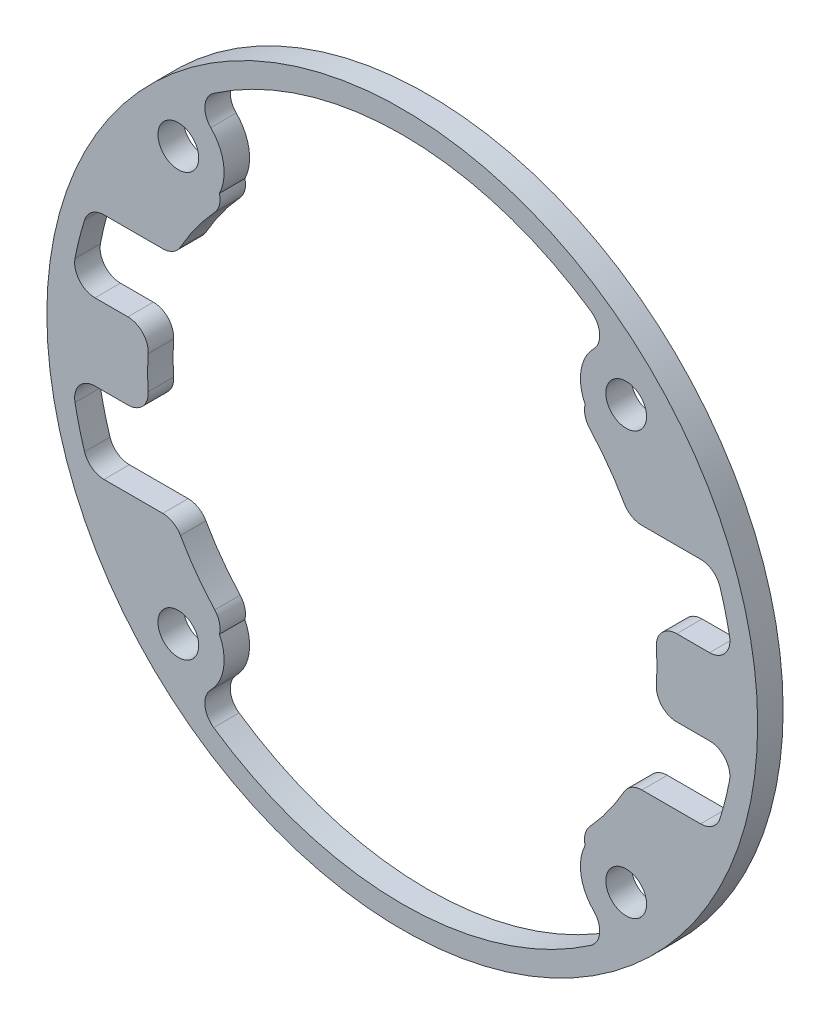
ISO-10303-21;
HEADER;
FILE_DESCRIPTION(('STEP AP214'),'2;1');
FILE_NAME('part.step','',(''),(''),'','','');
FILE_SCHEMA(('AUTOMOTIVE_DESIGN { 1 0 10303 214 1 1 1 1 }'));
ENDSEC;
DATA;
#1=APPLICATION_CONTEXT('core data for automotive mechanical design processes');
#2=APPLICATION_PROTOCOL_DEFINITION('international standard','automotive_design',2000,#1);
#3=PRODUCT_CONTEXT('',#1,'mechanical');
#4=PRODUCT('Part','Part','',(#3));
#5=PRODUCT_RELATED_PRODUCT_CATEGORY('part','',(#4));
#6=PRODUCT_DEFINITION_FORMATION('','',#4);
#7=PRODUCT_DEFINITION_CONTEXT('part definition',#1,'design');
#8=PRODUCT_DEFINITION('design','',#6,#7);
#9=PRODUCT_DEFINITION_SHAPE('','',#8);
#10=(LENGTH_UNIT() NAMED_UNIT(*) SI_UNIT(.MILLI.,.METRE.));
#11=(NAMED_UNIT(*) PLANE_ANGLE_UNIT() SI_UNIT($,.RADIAN.));
#12=(NAMED_UNIT(*) SI_UNIT($,.STERADIAN.) SOLID_ANGLE_UNIT());
#13=UNCERTAINTY_MEASURE_WITH_UNIT(LENGTH_MEASURE(1.E-05),#10,'distance_accuracy_value','');
#14=(GEOMETRIC_REPRESENTATION_CONTEXT(3) GLOBAL_UNCERTAINTY_ASSIGNED_CONTEXT((#13)) GLOBAL_UNIT_ASSIGNED_CONTEXT((#10,
#11,#12)) REPRESENTATION_CONTEXT('',''));
#15=CARTESIAN_POINT('',(0.,0.,0.));
#16=DIRECTION('',(0.,0.,1.));
#17=DIRECTION('',(1.,0.,0.));
#18=AXIS2_PLACEMENT_3D('',#15,#16,#17);
#19=CARTESIAN_POINT('',(-20.6375,2.38125,1.5875));
#20=DIRECTION('',(0.,1.,0.));
#21=DIRECTION('',(-1.,0.,0.));
#22=AXIS2_PLACEMENT_3D('',#19,#20,#21);
#23=PLANE('',#22);
#24=DIRECTION('',(1.,0.,0.));
#25=VECTOR('',#24,1.);
#26=CARTESIAN_POINT('',(-20.6375,2.38125,1.5875));
#27=LINE('',#26,#25);
#28=CARTESIAN_POINT('',(-19.1596187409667,2.38125,1.5875));
#29=VERTEX_POINT('',#28);
#30=CARTESIAN_POINT('',(-17.1089493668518,2.38125,1.5875));
#31=VERTEX_POINT('',#30);
#32=EDGE_CURVE('E600',#29,#31,#27,.T.);
#33=ORIENTED_EDGE('',*,*,#32,.T.);
#34=DIRECTION('',(0.,0.,-1.));
#35=VECTOR('',#34,1.);
#36=CARTESIAN_POINT('',(-17.1089493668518,2.38125,0.));
#37=LINE('',#36,#35);
#38=CARTESIAN_POINT('',(-17.1089493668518,2.38125,0.));
#39=VERTEX_POINT('',#38);
#40=EDGE_CURVE('E483',#31,#39,#37,.T.);
#41=ORIENTED_EDGE('',*,*,#40,.T.);
#42=DIRECTION('',(1.,0.,0.));
#43=VECTOR('',#42,1.);
#44=CARTESIAN_POINT('',(-20.6375,2.38125,0.));
#45=LINE('',#44,#43);
#46=CARTESIAN_POINT('',(-19.1596187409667,2.38125,0.));
#47=VERTEX_POINT('',#46);
#48=EDGE_CURVE('E588',#47,#39,#45,.T.);
#49=ORIENTED_EDGE('',*,*,#48,.F.);
#50=DIRECTION('',(0.,0.,1.));
#51=VECTOR('',#50,1.);
#52=CARTESIAN_POINT('',(-19.1596187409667,2.38125,1.5875));
#53=LINE('',#52,#51);
#54=EDGE_CURVE('E481',#47,#29,#53,.T.);
#55=ORIENTED_EDGE('',*,*,#54,.T.);
#56=EDGE_LOOP('',(#33,#41,#49,#55));
#57=FACE_BOUND('',#56,.T.);
#58=ADVANCED_FACE('F31',(#57),#23,.T.);
#59=CARTESIAN_POINT('',(-19.5075265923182,7.14375,1.5875));
#60=DIRECTION('',(0.,-1.,0.));
#61=DIRECTION('',(1.,0.,0.));
#62=AXIS2_PLACEMENT_3D('',#59,#60,#61);
#63=PLANE('',#62);
#64=DIRECTION('',(-1.,0.,0.));
#65=VECTOR('',#64,1.);
#66=CARTESIAN_POINT('',(-19.5075265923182,7.14375,1.5875));
#67=LINE('',#66,#65);
#68=CARTESIAN_POINT('',(18.5989698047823,7.14375,1.5875));
#69=VERTEX_POINT('',#68);
#70=CARTESIAN_POINT('',(14.9385352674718,7.14375,1.5875));
#71=VERTEX_POINT('',#70);
#72=EDGE_CURVE('E609',#69,#71,#67,.T.);
#73=ORIENTED_EDGE('',*,*,#72,.T.);
#74=DIRECTION('',(0.,0.,-1.));
#75=VECTOR('',#74,1.);
#76=CARTESIAN_POINT('',(14.9385352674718,7.14375,0.));
#77=LINE('',#76,#75);
#78=CARTESIAN_POINT('',(14.9385352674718,7.14375,0.));
#79=VERTEX_POINT('',#78);
#80=EDGE_CURVE('E409',#71,#79,#77,.T.);
#81=ORIENTED_EDGE('',*,*,#80,.T.);
#82=DIRECTION('',(-1.,0.,0.));
#83=VECTOR('',#82,1.);
#84=CARTESIAN_POINT('',(-19.5075265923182,7.14375,0.));
#85=LINE('',#84,#83);
#86=CARTESIAN_POINT('',(18.5989698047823,7.14375,0.));
#87=VERTEX_POINT('',#86);
#88=EDGE_CURVE('E595',#87,#79,#85,.T.);
#89=ORIENTED_EDGE('',*,*,#88,.F.);
#90=DIRECTION('',(0.,0.,1.));
#91=VECTOR('',#90,1.);
#92=CARTESIAN_POINT('',(18.5989698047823,7.14375,1.5875));
#93=LINE('',#92,#91);
#94=EDGE_CURVE('E407',#87,#69,#93,.T.);
#95=ORIENTED_EDGE('',*,*,#94,.T.);
#96=EDGE_LOOP('',(#73,#81,#89,#95));
#97=FACE_BOUND('',#96,.T.);
#98=ADVANCED_FACE('F776',(#97),#63,.T.);
#99=CARTESIAN_POINT('',(-20.6375,-2.38125,1.5875));
#100=DIRECTION('',(0.,-1.,0.));
#101=DIRECTION('',(1.,0.,0.));
#102=AXIS2_PLACEMENT_3D('',#99,#100,#101);
#103=PLANE('',#102);
#104=DIRECTION('',(-1.,0.,0.));
#105=VECTOR('',#104,1.);
#106=CARTESIAN_POINT('',(-20.6375,-2.38125,0.));
#107=LINE('',#106,#105);
#108=CARTESIAN_POINT('',(19.1596187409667,-2.38125,0.));
#109=VERTEX_POINT('',#108);
#110=CARTESIAN_POINT('',(17.1089493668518,-2.38125,0.));
#111=VERTEX_POINT('',#110);
#112=EDGE_CURVE('E731',#109,#111,#107,.T.);
#113=ORIENTED_EDGE('',*,*,#112,.F.);
#114=DIRECTION('',(0.,0.,1.));
#115=VECTOR('',#114,1.);
#116=CARTESIAN_POINT('',(19.1596187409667,-2.38125,1.5875));
#117=LINE('',#116,#115);
#118=CARTESIAN_POINT('',(19.1596187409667,-2.38125,1.5875));
#119=VERTEX_POINT('',#118);
#120=EDGE_CURVE('E434',#109,#119,#117,.T.);
#121=ORIENTED_EDGE('',*,*,#120,.T.);
#122=DIRECTION('',(-1.,0.,0.));
#123=VECTOR('',#122,1.);
#124=CARTESIAN_POINT('',(-20.6375,-2.38125,1.5875));
#125=LINE('',#124,#123);
#126=CARTESIAN_POINT('',(17.1089493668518,-2.38125,1.5875));
#127=VERTEX_POINT('',#126);
#128=EDGE_CURVE('E749',#119,#127,#125,.T.);
#129=ORIENTED_EDGE('',*,*,#128,.T.);
#130=DIRECTION('',(0.,0.,-1.));
#131=VECTOR('',#130,1.);
#132=CARTESIAN_POINT('',(17.1089493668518,-2.38125,0.));
#133=LINE('',#132,#131);
#134=EDGE_CURVE('E432',#127,#111,#133,.T.);
#135=ORIENTED_EDGE('',*,*,#134,.T.);
#136=EDGE_LOOP('',(#113,#121,#129,#135));
#137=FACE_BOUND('',#136,.T.);
#138=ADVANCED_FACE('F783',(#137),#103,.T.);
#139=CARTESIAN_POINT('',(-19.5075265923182,-7.14375,1.5875));
#140=DIRECTION('',(0.,1.,0.));
#141=DIRECTION('',(-1.,0.,0.));
#142=AXIS2_PLACEMENT_3D('',#139,#140,#141);
#143=PLANE('',#142);
#144=DIRECTION('',(1.,0.,0.));
#145=VECTOR('',#144,1.);
#146=CARTESIAN_POINT('',(-19.5075265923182,-7.14375,1.5875));
#147=LINE('',#146,#145);
#148=CARTESIAN_POINT('',(-18.5989698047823,-7.14375,1.5875));
#149=VERTEX_POINT('',#148);
#150=CARTESIAN_POINT('',(-14.9385352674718,-7.14375,1.5875));
#151=VERTEX_POINT('',#150);
#152=EDGE_CURVE('E655',#149,#151,#147,.T.);
#153=ORIENTED_EDGE('',*,*,#152,.T.);
#154=DIRECTION('',(0.,0.,-1.));
#155=VECTOR('',#154,1.);
#156=CARTESIAN_POINT('',(-14.9385352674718,-7.14375,0.));
#157=LINE('',#156,#155);
#158=CARTESIAN_POINT('',(-14.9385352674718,-7.14375,0.));
#159=VERTEX_POINT('',#158);
#160=EDGE_CURVE('E463',#151,#159,#157,.T.);
#161=ORIENTED_EDGE('',*,*,#160,.T.);
#162=DIRECTION('',(1.,0.,0.));
#163=VECTOR('',#162,1.);
#164=CARTESIAN_POINT('',(-19.5075265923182,-7.14375,0.));
#165=LINE('',#164,#163);
#166=CARTESIAN_POINT('',(-18.5989698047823,-7.14375,0.));
#167=VERTEX_POINT('',#166);
#168=EDGE_CURVE('E640',#167,#159,#165,.T.);
#169=ORIENTED_EDGE('',*,*,#168,.F.);
#170=DIRECTION('',(0.,0.,1.));
#171=VECTOR('',#170,1.);
#172=CARTESIAN_POINT('',(-18.5989698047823,-7.14375,1.5875));
#173=LINE('',#172,#171);
#174=EDGE_CURVE('E461',#167,#149,#173,.T.);
#175=ORIENTED_EDGE('',*,*,#174,.T.);
#176=EDGE_LOOP('',(#153,#161,#169,#175));
#177=FACE_BOUND('',#176,.T.);
#178=ADVANCED_FACE('F659',(#177),#143,.T.);
#179=CARTESIAN_POINT('',(0.,0.,1.5875));
#180=DIRECTION('',(0.,0.,1.));
#181=DIRECTION('',(1.,0.,0.));
#182=AXIS2_PLACEMENT_3D('',#179,#180,#181);
#183=PLANE('',#182);
#184=CARTESIAN_POINT('',(13.962259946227,13.1662436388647,1.5875));
#185=DIRECTION('',(0.,0.,-1.));
#186=DIRECTION('',(1.,0.,0.));
#187=AXIS2_PLACEMENT_3D('',#184,#185,#186);
#188=CIRCLE('',#187,2.85478665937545);
#189=CARTESIAN_POINT('',(11.4005763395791,11.90625,1.5875));
#190=VERTEX_POINT('',#189);
#191=CARTESIAN_POINT('',(11.940529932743,15.1817868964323,1.5875));
#192=VERTEX_POINT('',#191);
#193=EDGE_CURVE('E556',#190,#192,#188,.T.);
#194=ORIENTED_EDGE('',*,*,#193,.F.);
#195=CARTESIAN_POINT('',(12.6313610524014,11.5930903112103,1.5875));
#196=DIRECTION('',(0.,0.,1.));
#197=DIRECTION('',(1.,0.,0.));
#198=AXIS2_PLACEMENT_3D('',#195,#196,#197);
#199=CIRCLE('',#198,1.27);
#200=CARTESIAN_POINT('',(11.6957046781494,10.7343428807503,1.5875));
#201=VERTEX_POINT('',#200);
#202=EDGE_CURVE('E405',#190,#201,#199,.T.);
#203=ORIENTED_EDGE('',*,*,#202,.T.);
#204=CARTESIAN_POINT('',(0.,0.,1.5875));
#205=DIRECTION('',(0.,0.,1.));
#206=DIRECTION('',(1.,0.,0.));
#207=AXIS2_PLACEMENT_3D('',#204,#205,#206);
#208=CIRCLE('',#207,15.875);
#209=CARTESIAN_POINT('',(13.831977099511,7.79050925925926,1.5875));
#210=VERTEX_POINT('',#209);
#211=EDGE_CURVE('E692',#210,#201,#208,.T.);
#212=ORIENTED_EDGE('',*,*,#211,.F.);
#213=CARTESIAN_POINT('',(14.9385352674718,8.41375,1.5875));
#214=DIRECTION('',(0.,0.,1.));
#215=DIRECTION('',(1.,0.,0.));
#216=AXIS2_PLACEMENT_3D('',#213,#214,#215);
#217=CIRCLE('',#216,1.27);
#218=EDGE_CURVE('E403',#210,#71,#217,.T.);
#219=ORIENTED_EDGE('',*,*,#218,.T.);
#220=ORIENTED_EDGE('',*,*,#72,.F.);
#221=CARTESIAN_POINT('',(18.5989698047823,5.87375,1.5875));
#222=DIRECTION('',(0.,0.,1.));
#223=DIRECTION('',(1.,0.,0.));
#224=AXIS2_PLACEMENT_3D('',#221,#222,#223);
#225=CIRCLE('',#224,1.27);
#226=CARTESIAN_POINT('',(19.8100124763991,6.25620999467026,1.5875));
#227=VERTEX_POINT('',#226);
#228=EDGE_CURVE('E512',#69,#227,#225,.F.);
#229=ORIENTED_EDGE('',*,*,#228,.T.);
#230=CARTESIAN_POINT('',(0.,0.,1.5875));
#231=DIRECTION('',(0.,0.,1.));
#232=DIRECTION('',(1.,0.,0.));
#233=AXIS2_PLACEMENT_3D('',#230,#231,#232);
#234=CIRCLE('',#233,20.7744255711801);
#235=CARTESIAN_POINT('',(20.4071671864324,3.88899540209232,1.5875));
#236=VERTEX_POINT('',#235);
#237=EDGE_CURVE('E603',#236,#227,#234,.T.);
#238=ORIENTED_EDGE('',*,*,#237,.F.);
#239=CARTESIAN_POINT('',(19.1596187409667,3.65125,1.5875));
#240=DIRECTION('',(0.,0.,1.));
#241=DIRECTION('',(1.,0.,0.));
#242=AXIS2_PLACEMENT_3D('',#239,#240,#241);
#243=CIRCLE('',#242,1.27);
#244=CARTESIAN_POINT('',(19.1596187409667,2.38125,1.5875));
#245=VERTEX_POINT('',#244);
#246=EDGE_CURVE('E508',#236,#245,#243,.F.);
#247=ORIENTED_EDGE('',*,*,#246,.T.);
#248=CARTESIAN_POINT('',(17.1089493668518,2.38125,1.5875));
#249=VERTEX_POINT('',#248);
#250=EDGE_CURVE('E599',#249,#245,#27,.T.);
#251=ORIENTED_EDGE('',*,*,#250,.F.);
#252=CARTESIAN_POINT('',(17.1089493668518,1.11125,1.5875));
#253=DIRECTION('',(0.,0.,1.));
#254=DIRECTION('',(1.,0.,0.));
#255=AXIS2_PLACEMENT_3D('',#252,#253,#254);
#256=CIRCLE('',#255,1.27);
#257=CARTESIAN_POINT('',(15.8416197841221,1.02893518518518,1.5875));
#258=VERTEX_POINT('',#257);
#259=EDGE_CURVE('E401',#249,#258,#256,.T.);
#260=ORIENTED_EDGE('',*,*,#259,.T.);
#261=CARTESIAN_POINT('',(15.8416197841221,-1.02893518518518,1.5875));
#262=VERTEX_POINT('',#261);
#263=EDGE_CURVE('E699',#262,#258,#208,.T.);
#264=ORIENTED_EDGE('',*,*,#263,.F.);
#265=CARTESIAN_POINT('',(17.1089493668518,-1.11125,1.5875));
#266=DIRECTION('',(0.,0.,1.));
#267=DIRECTION('',(1.,0.,0.));
#268=AXIS2_PLACEMENT_3D('',#265,#266,#267);
#269=CIRCLE('',#268,1.27);
#270=EDGE_CURVE('E399',#262,#127,#269,.T.);
#271=ORIENTED_EDGE('',*,*,#270,.T.);
#272=ORIENTED_EDGE('',*,*,#128,.F.);
#273=CARTESIAN_POINT('',(19.1596187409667,-3.65125,1.5875));
#274=DIRECTION('',(0.,0.,1.));
#275=DIRECTION('',(1.,0.,0.));
#276=AXIS2_PLACEMENT_3D('',#273,#274,#275);
#277=CIRCLE('',#276,1.27);
#278=CARTESIAN_POINT('',(20.4071671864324,-3.88899540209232,1.5875));
#279=VERTEX_POINT('',#278);
#280=EDGE_CURVE('E516',#119,#279,#277,.F.);
#281=ORIENTED_EDGE('',*,*,#280,.T.);
#282=CARTESIAN_POINT('',(0.,0.,1.5875));
#283=DIRECTION('',(0.,0.,1.));
#284=DIRECTION('',(-1.,0.,0.));
#285=AXIS2_PLACEMENT_3D('',#282,#283,#284);
#286=CIRCLE('',#285,20.7744255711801);
#287=CARTESIAN_POINT('',(19.8100124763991,-6.25620999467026,1.5875));
#288=VERTEX_POINT('',#287);
#289=EDGE_CURVE('E746',#288,#279,#286,.T.);
#290=ORIENTED_EDGE('',*,*,#289,.F.);
#291=CARTESIAN_POINT('',(18.5989698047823,-5.87375,1.5875));
#292=DIRECTION('',(0.,0.,1.));
#293=DIRECTION('',(1.,0.,0.));
#294=AXIS2_PLACEMENT_3D('',#291,#292,#293);
#295=CIRCLE('',#294,1.27);
#296=CARTESIAN_POINT('',(18.5989698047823,-7.14375,1.5875));
#297=VERTEX_POINT('',#296);
#298=EDGE_CURVE('E520',#288,#297,#295,.F.);
#299=ORIENTED_EDGE('',*,*,#298,.T.);
#300=CARTESIAN_POINT('',(14.9385352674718,-7.14375,1.5875));
#301=VERTEX_POINT('',#300);
#302=EDGE_CURVE('E661',#301,#297,#147,.T.);
#303=ORIENTED_EDGE('',*,*,#302,.F.);
#304=CARTESIAN_POINT('',(14.9385352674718,-8.41375,1.5875));
#305=DIRECTION('',(0.,0.,1.));
#306=DIRECTION('',(1.,0.,0.));
#307=AXIS2_PLACEMENT_3D('',#304,#305,#306);
#308=CIRCLE('',#307,1.27);
#309=CARTESIAN_POINT('',(13.831977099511,-7.79050925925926,1.5875));
#310=VERTEX_POINT('',#309);
#311=EDGE_CURVE('E397',#301,#310,#308,.T.);
#312=ORIENTED_EDGE('',*,*,#311,.T.);
#313=CARTESIAN_POINT('',(11.6957046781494,-10.7343428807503,1.5875));
#314=VERTEX_POINT('',#313);
#315=EDGE_CURVE('E703',#314,#310,#208,.T.);
#316=ORIENTED_EDGE('',*,*,#315,.F.);
#317=CARTESIAN_POINT('',(12.6313610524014,-11.5930903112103,1.5875));
#318=DIRECTION('',(0.,0.,1.));
#319=DIRECTION('',(1.,0.,0.));
#320=AXIS2_PLACEMENT_3D('',#317,#318,#319);
#321=CIRCLE('',#320,1.27);
#322=CARTESIAN_POINT('',(11.4005763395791,-11.90625,1.5875));
#323=VERTEX_POINT('',#322);
#324=EDGE_CURVE('E395',#314,#323,#321,.T.);
#325=ORIENTED_EDGE('',*,*,#324,.T.);
#326=CARTESIAN_POINT('',(13.962259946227,-13.1662436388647,1.5875));
#327=DIRECTION('',(0.,0.,-1.));
#328=DIRECTION('',(-1.,0.,0.));
#329=AXIS2_PLACEMENT_3D('',#326,#327,#328);
#330=CIRCLE('',#329,2.85478665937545);
#331=CARTESIAN_POINT('',(11.940529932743,-15.1817868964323,1.5875));
#332=VERTEX_POINT('',#331);
#333=EDGE_CURVE('E359',#332,#323,#330,.T.);
#334=ORIENTED_EDGE('',*,*,#333,.F.);
#335=CARTESIAN_POINT('',(11.0411292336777,-16.07843531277,1.5875));
#336=DIRECTION('',(0.,0.,1.));
#337=DIRECTION('',(1.,0.,0.));
#338=AXIS2_PLACEMENT_3D('',#335,#336,#337);
#339=CIRCLE('',#338,1.27);
#340=CARTESIAN_POINT('',(11.7600550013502,-17.1253573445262,1.5875));
#341=VERTEX_POINT('',#340);
#342=EDGE_CURVE('E523',#332,#341,#339,.F.);
#343=ORIENTED_EDGE('',*,*,#342,.T.);
#344=CARTESIAN_POINT('',(0.,0.,1.5875));
#345=DIRECTION('',(0.,0.,1.));
#346=DIRECTION('',(1.,0.,0.));
#347=AXIS2_PLACEMENT_3D('',#344,#345,#346);
#348=CIRCLE('',#347,20.7744255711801);
#349=CARTESIAN_POINT('',(-11.7600550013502,-17.1253573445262,1.5875));
#350=VERTEX_POINT('',#349);
#351=EDGE_CURVE('E671',#350,#341,#348,.T.);
#352=ORIENTED_EDGE('',*,*,#351,.F.);
#353=CARTESIAN_POINT('',(-11.0411292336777,-16.07843531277,1.5875));
#354=DIRECTION('',(0.,0.,1.));
#355=DIRECTION('',(1.,0.,0.));
#356=AXIS2_PLACEMENT_3D('',#353,#354,#355);
#357=CIRCLE('',#356,1.27);
#358=CARTESIAN_POINT('',(-11.940529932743,-15.1817868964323,1.5875));
#359=VERTEX_POINT('',#358);
#360=EDGE_CURVE('E527',#350,#359,#357,.F.);
#361=ORIENTED_EDGE('',*,*,#360,.T.);
#362=CARTESIAN_POINT('',(-13.962259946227,-13.1662436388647,1.5875));
#363=DIRECTION('',(0.,0.,-1.));
#364=DIRECTION('',(1.,0.,0.));
#365=AXIS2_PLACEMENT_3D('',#362,#363,#364);
#366=CIRCLE('',#365,2.85478665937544);
#367=CARTESIAN_POINT('',(-11.4005763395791,-11.90625,1.5875));
#368=VERTEX_POINT('',#367);
#369=EDGE_CURVE('E675',#368,#359,#366,.T.);
#370=ORIENTED_EDGE('',*,*,#369,.F.);
#371=CARTESIAN_POINT('',(-12.6313610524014,-11.5930903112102,1.5875));
#372=DIRECTION('',(0.,0.,1.));
#373=DIRECTION('',(1.,0.,0.));
#374=AXIS2_PLACEMENT_3D('',#371,#372,#373);
#375=CIRCLE('',#374,1.27);
#376=CARTESIAN_POINT('',(-11.6957046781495,-10.7343428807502,1.5875));
#377=VERTEX_POINT('',#376);
#378=EDGE_CURVE('E393',#368,#377,#375,.T.);
#379=ORIENTED_EDGE('',*,*,#378,.T.);
#380=CARTESIAN_POINT('',(-13.831977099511,-7.79050925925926,1.5875));
#381=VERTEX_POINT('',#380);
#382=EDGE_CURVE('E657',#381,#377,#208,.T.);
#383=ORIENTED_EDGE('',*,*,#382,.F.);
#384=CARTESIAN_POINT('',(-14.9385352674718,-8.41375,1.5875));
#385=DIRECTION('',(0.,0.,1.));
#386=DIRECTION('',(1.,0.,0.));
#387=AXIS2_PLACEMENT_3D('',#384,#385,#386);
#388=CIRCLE('',#387,1.27);
#389=EDGE_CURVE('E391',#381,#151,#388,.T.);
#390=ORIENTED_EDGE('',*,*,#389,.T.);
#391=ORIENTED_EDGE('',*,*,#152,.F.);
#392=CARTESIAN_POINT('',(-18.5989698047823,-5.87375,1.5875));
#393=DIRECTION('',(0.,0.,1.));
#394=DIRECTION('',(1.,0.,0.));
#395=AXIS2_PLACEMENT_3D('',#392,#393,#394);
#396=CIRCLE('',#395,1.27);
#397=CARTESIAN_POINT('',(-19.8100124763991,-6.25620999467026,1.5875));
#398=VERTEX_POINT('',#397);
#399=EDGE_CURVE('E531',#149,#398,#396,.F.);
#400=ORIENTED_EDGE('',*,*,#399,.T.);
#401=CARTESIAN_POINT('',(0.,0.,1.5875));
#402=DIRECTION('',(0.,0.,1.));
#403=DIRECTION('',(1.,0.,0.));
#404=AXIS2_PLACEMENT_3D('',#401,#402,#403);
#405=CIRCLE('',#404,20.7744255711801);
#406=CARTESIAN_POINT('',(-20.4071671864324,-3.88899540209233,1.5875));
#407=VERTEX_POINT('',#406);
#408=EDGE_CURVE('E665',#407,#398,#405,.T.);
#409=ORIENTED_EDGE('',*,*,#408,.F.);
#410=CARTESIAN_POINT('',(-19.1596187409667,-3.65125,1.5875));
#411=DIRECTION('',(0.,0.,1.));
#412=DIRECTION('',(1.,0.,0.));
#413=AXIS2_PLACEMENT_3D('',#410,#411,#412);
#414=CIRCLE('',#413,1.27);
#415=CARTESIAN_POINT('',(-19.1596187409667,-2.38125,1.5875));
#416=VERTEX_POINT('',#415);
#417=EDGE_CURVE('E535',#407,#416,#414,.F.);
#418=ORIENTED_EDGE('',*,*,#417,.T.);
#419=CARTESIAN_POINT('',(-17.1089493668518,-2.38125,1.5875));
#420=VERTEX_POINT('',#419);
#421=EDGE_CURVE('E748',#420,#416,#125,.T.);
#422=ORIENTED_EDGE('',*,*,#421,.F.);
#423=CARTESIAN_POINT('',(-17.1089493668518,-1.11125,1.5875));
#424=DIRECTION('',(0.,0.,1.));
#425=DIRECTION('',(1.,0.,0.));
#426=AXIS2_PLACEMENT_3D('',#423,#424,#425);
#427=CIRCLE('',#426,1.27);
#428=CARTESIAN_POINT('',(-15.8416197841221,-1.02893518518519,1.5875));
#429=VERTEX_POINT('',#428);
#430=EDGE_CURVE('E389',#420,#429,#427,.T.);
#431=ORIENTED_EDGE('',*,*,#430,.T.);
#432=CARTESIAN_POINT('',(-15.8416197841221,1.02893518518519,1.5875));
#433=VERTEX_POINT('',#432);
#434=EDGE_CURVE('E701',#433,#429,#208,.T.);
#435=ORIENTED_EDGE('',*,*,#434,.F.);
#436=CARTESIAN_POINT('',(-17.1089493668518,1.11125,1.5875));
#437=DIRECTION('',(0.,0.,1.));
#438=DIRECTION('',(1.,0.,0.));
#439=AXIS2_PLACEMENT_3D('',#436,#437,#438);
#440=CIRCLE('',#439,1.27);
#441=EDGE_CURVE('E387',#433,#31,#440,.T.);
#442=ORIENTED_EDGE('',*,*,#441,.T.);
#443=ORIENTED_EDGE('',*,*,#32,.F.);
#444=CARTESIAN_POINT('',(-19.1596187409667,3.65125,1.5875));
#445=DIRECTION('',(0.,0.,1.));
#446=DIRECTION('',(1.,0.,0.));
#447=AXIS2_PLACEMENT_3D('',#444,#445,#446);
#448=CIRCLE('',#447,1.27);
#449=CARTESIAN_POINT('',(-20.4071671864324,3.88899540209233,1.5875));
#450=VERTEX_POINT('',#449);
#451=EDGE_CURVE('E539',#29,#450,#448,.F.);
#452=ORIENTED_EDGE('',*,*,#451,.T.);
#453=CARTESIAN_POINT('',(0.,0.,1.5875));
#454=DIRECTION('',(0.,0.,1.));
#455=DIRECTION('',(-1.,0.,0.));
#456=AXIS2_PLACEMENT_3D('',#453,#454,#455);
#457=CIRCLE('',#456,20.7744255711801);
#458=CARTESIAN_POINT('',(-19.8100124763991,6.25620999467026,1.5875));
#459=VERTEX_POINT('',#458);
#460=EDGE_CURVE('E596',#459,#450,#457,.T.);
#461=ORIENTED_EDGE('',*,*,#460,.F.);
#462=CARTESIAN_POINT('',(-18.5989698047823,5.87375,1.5875));
#463=DIRECTION('',(0.,0.,1.));
#464=DIRECTION('',(1.,0.,0.));
#465=AXIS2_PLACEMENT_3D('',#462,#463,#464);
#466=CIRCLE('',#465,1.27);
#467=CARTESIAN_POINT('',(-18.5989698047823,7.14375,1.5875));
#468=VERTEX_POINT('',#467);
#469=EDGE_CURVE('E543',#459,#468,#466,.F.);
#470=ORIENTED_EDGE('',*,*,#469,.T.);
#471=CARTESIAN_POINT('',(-14.9385352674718,7.14375,1.5875));
#472=VERTEX_POINT('',#471);
#473=EDGE_CURVE('E606',#472,#468,#67,.T.);
#474=ORIENTED_EDGE('',*,*,#473,.F.);
#475=CARTESIAN_POINT('',(-14.9385352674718,8.41375,1.5875));
#476=DIRECTION('',(0.,0.,1.));
#477=DIRECTION('',(1.,0.,0.));
#478=AXIS2_PLACEMENT_3D('',#475,#476,#477);
#479=CIRCLE('',#478,1.27);
#480=CARTESIAN_POINT('',(-13.831977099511,7.79050925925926,1.5875));
#481=VERTEX_POINT('',#480);
#482=EDGE_CURVE('E54',#472,#481,#479,.T.);
#483=ORIENTED_EDGE('',*,*,#482,.T.);
#484=CARTESIAN_POINT('',(-11.6957046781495,10.7343428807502,1.5875));
#485=VERTEX_POINT('',#484);
#486=EDGE_CURVE('E697',#485,#481,#208,.T.);
#487=ORIENTED_EDGE('',*,*,#486,.F.);
#488=CARTESIAN_POINT('',(-12.6313610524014,11.5930903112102,1.5875));
#489=DIRECTION('',(0.,0.,1.));
#490=DIRECTION('',(1.,0.,0.));
#491=AXIS2_PLACEMENT_3D('',#488,#489,#490);
#492=CIRCLE('',#491,1.27);
#493=CARTESIAN_POINT('',(-11.4005763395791,11.90625,1.5875));
#494=VERTEX_POINT('',#493);
#495=EDGE_CURVE('E384',#485,#494,#492,.T.);
#496=ORIENTED_EDGE('',*,*,#495,.T.);
#497=CARTESIAN_POINT('',(-13.962259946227,13.1662436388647,1.5875));
#498=DIRECTION('',(0.,0.,-1.));
#499=DIRECTION('',(-1.,0.,0.));
#500=AXIS2_PLACEMENT_3D('',#497,#498,#499);
#501=CIRCLE('',#500,2.85478665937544);
#502=CARTESIAN_POINT('',(-11.940529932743,15.1817868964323,1.5875));
#503=VERTEX_POINT('',#502);
#504=EDGE_CURVE('E568',#503,#494,#501,.T.);
#505=ORIENTED_EDGE('',*,*,#504,.F.);
#506=CARTESIAN_POINT('',(-11.0411292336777,16.07843531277,1.5875));
#507=DIRECTION('',(0.,0.,1.));
#508=DIRECTION('',(1.,0.,0.));
#509=AXIS2_PLACEMENT_3D('',#506,#507,#508);
#510=CIRCLE('',#509,1.27);
#511=CARTESIAN_POINT('',(-11.7600550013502,17.1253573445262,1.5875));
#512=VERTEX_POINT('',#511);
#513=EDGE_CURVE('E11',#503,#512,#510,.F.);
#514=ORIENTED_EDGE('',*,*,#513,.T.);
#515=CARTESIAN_POINT('',(0.,0.,1.5875));
#516=DIRECTION('',(0.,0.,1.));
#517=DIRECTION('',(-1.,0.,0.));
#518=AXIS2_PLACEMENT_3D('',#515,#516,#517);
#519=CIRCLE('',#518,20.7744255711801);
#520=CARTESIAN_POINT('',(11.7600550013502,17.1253573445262,1.5875));
#521=VERTEX_POINT('',#520);
#522=EDGE_CURVE('E566',#521,#512,#519,.T.);
#523=ORIENTED_EDGE('',*,*,#522,.F.);
#524=CARTESIAN_POINT('',(11.0411292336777,16.07843531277,1.5875));
#525=DIRECTION('',(0.,0.,1.));
#526=DIRECTION('',(1.,0.,0.));
#527=AXIS2_PLACEMENT_3D('',#524,#525,#526);
#528=CIRCLE('',#527,1.27);
#529=EDGE_CURVE('E504',#521,#192,#528,.F.);
#530=ORIENTED_EDGE('',*,*,#529,.T.);
#531=EDGE_LOOP('',(#194,#203,#212,#219,#220,#229,#238,#247,#251,#260,#264,#271,#272,#281,#290,
#299,#303,#312,#316,#325,#334,#343,#352,#361,#370,#379,#383,#390,#391,#400,#409,#418,#422,#431,
#435,#442,#443,#452,#461,#470,#474,#483,#487,#496,#505,#514,#523,#530));
#532=FACE_BOUND('',#531,.T.);
#533=CARTESIAN_POINT('',(13.962259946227,-13.1662436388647,1.5875));
#534=DIRECTION('',(0.,0.,1.));
#535=DIRECTION('',(1.,0.,0.));
#536=AXIS2_PLACEMENT_3D('',#533,#534,#535);
#537=CIRCLE('',#536,1.27);
#538=CARTESIAN_POINT('',(15.232259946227,-13.1662436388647,1.5875));
#539=VERTEX_POINT('',#538);
#540=EDGE_CURVE('E838',#539,#539,#537,.T.);
#541=ORIENTED_EDGE('',*,*,#540,.F.);
#542=EDGE_LOOP('',(#541));
#543=FACE_BOUND('',#542,.T.);
#544=CARTESIAN_POINT('',(-13.962259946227,13.1662436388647,1.5875));
#545=DIRECTION('',(0.,0.,1.));
#546=DIRECTION('',(1.,0.,0.));
#547=AXIS2_PLACEMENT_3D('',#544,#545,#546);
#548=CIRCLE('',#547,1.27);
#549=CARTESIAN_POINT('',(-12.692259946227,13.1662436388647,1.5875));
#550=VERTEX_POINT('',#549);
#551=EDGE_CURVE('E737',#550,#550,#548,.T.);
#552=ORIENTED_EDGE('',*,*,#551,.F.);
#553=EDGE_LOOP('',(#552));
#554=FACE_BOUND('',#553,.T.);
#555=CARTESIAN_POINT('',(0.,0.,1.5875));
#556=DIRECTION('',(0.,0.,1.));
#557=DIRECTION('',(1.,0.,0.));
#558=AXIS2_PLACEMENT_3D('',#555,#556,#557);
#559=CIRCLE('',#558,22.1615);
#560=CARTESIAN_POINT('',(22.1615,0.,1.5875));
#561=VERTEX_POINT('',#560);
#562=EDGE_CURVE('E613',#561,#561,#559,.T.);
#563=ORIENTED_EDGE('',*,*,#562,.T.);
#564=EDGE_LOOP('',(#563));
#565=FACE_BOUND('',#564,.T.);
#566=CARTESIAN_POINT('',(13.962259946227,13.1662436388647,1.5875));
#567=DIRECTION('',(0.,0.,1.));
#568=DIRECTION('',(-1.,0.,0.));
#569=AXIS2_PLACEMENT_3D('',#566,#567,#568);
#570=CIRCLE('',#569,1.27);
#571=CARTESIAN_POINT('',(12.692259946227,13.1662436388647,1.5875));
#572=VERTEX_POINT('',#571);
#573=EDGE_CURVE('E844',#572,#572,#570,.T.);
#574=ORIENTED_EDGE('',*,*,#573,.F.);
#575=EDGE_LOOP('',(#574));
#576=FACE_BOUND('',#575,.T.);
#577=CARTESIAN_POINT('',(-13.962259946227,-13.1662436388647,1.5875));
#578=DIRECTION('',(0.,0.,1.));
#579=DIRECTION('',(-1.,0.,0.));
#580=AXIS2_PLACEMENT_3D('',#577,#578,#579);
#581=CIRCLE('',#580,1.27);
#582=CARTESIAN_POINT('',(-15.232259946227,-13.1662436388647,1.5875));
#583=VERTEX_POINT('',#582);
#584=EDGE_CURVE('E832',#583,#583,#581,.T.);
#585=ORIENTED_EDGE('',*,*,#584,.F.);
#586=EDGE_LOOP('',(#585));
#587=FACE_BOUND('',#586,.T.);
#588=ADVANCED_FACE('F564',(#532,#543,#554,#565,#576,#587),#183,.T.);
#589=CARTESIAN_POINT('',(0.,0.,0.));
#590=DIRECTION('',(0.,0.,1.));
#591=DIRECTION('',(1.,0.,0.));
#592=AXIS2_PLACEMENT_3D('',#589,#590,#591);
#593=PLANE('',#592);
#594=CARTESIAN_POINT('',(13.962259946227,-13.1662436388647,0.));
#595=DIRECTION('',(0.,0.,1.));
#596=DIRECTION('',(1.,0.,0.));
#597=AXIS2_PLACEMENT_3D('',#594,#595,#596);
#598=CIRCLE('',#597,1.27);
#599=CARTESIAN_POINT('',(15.232259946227,-13.1662436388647,0.));
#600=VERTEX_POINT('',#599);
#601=EDGE_CURVE('E835',#600,#600,#598,.T.);
#602=ORIENTED_EDGE('',*,*,#601,.T.);
#603=EDGE_LOOP('',(#602));
#604=FACE_BOUND('',#603,.T.);
#605=CARTESIAN_POINT('',(-13.962259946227,13.1662436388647,0.));
#606=DIRECTION('',(0.,0.,1.));
#607=DIRECTION('',(1.,0.,0.));
#608=AXIS2_PLACEMENT_3D('',#605,#606,#607);
#609=CIRCLE('',#608,1.27);
#610=CARTESIAN_POINT('',(-12.692259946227,13.1662436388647,0.));
#611=VERTEX_POINT('',#610);
#612=EDGE_CURVE('E847',#611,#611,#609,.T.);
#613=ORIENTED_EDGE('',*,*,#612,.T.);
#614=EDGE_LOOP('',(#613));
#615=FACE_BOUND('',#614,.T.);
#616=CARTESIAN_POINT('',(0.,0.,0.));
#617=DIRECTION('',(0.,0.,1.));
#618=DIRECTION('',(1.,0.,0.));
#619=AXIS2_PLACEMENT_3D('',#616,#617,#618);
#620=CIRCLE('',#619,22.1615);
#621=CARTESIAN_POINT('',(22.1615,0.,0.));
#622=VERTEX_POINT('',#621);
#623=EDGE_CURVE('E610',#622,#622,#620,.T.);
#624=ORIENTED_EDGE('',*,*,#623,.F.);
#625=EDGE_LOOP('',(#624));
#626=FACE_BOUND('',#625,.T.);
#627=CARTESIAN_POINT('',(0.,0.,0.));
#628=DIRECTION('',(0.,0.,1.));
#629=DIRECTION('',(1.,0.,0.));
#630=AXIS2_PLACEMENT_3D('',#627,#628,#629);
#631=CIRCLE('',#630,15.875);
#632=CARTESIAN_POINT('',(13.831977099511,7.79050925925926,0.));
#633=VERTEX_POINT('',#632);
#634=CARTESIAN_POINT('',(11.6957046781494,10.7343428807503,0.));
#635=VERTEX_POINT('',#634);
#636=EDGE_CURVE('E824',#633,#635,#631,.T.);
#637=ORIENTED_EDGE('',*,*,#636,.T.);
#638=CARTESIAN_POINT('',(12.6313610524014,11.5930903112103,0.));
#639=DIRECTION('',(0.,0.,1.));
#640=DIRECTION('',(1.,0.,0.));
#641=AXIS2_PLACEMENT_3D('',#638,#639,#640);
#642=CIRCLE('',#641,1.27);
#643=CARTESIAN_POINT('',(11.4005763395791,11.90625,0.));
#644=VERTEX_POINT('',#643);
#645=EDGE_CURVE('E382',#635,#644,#642,.F.);
#646=ORIENTED_EDGE('',*,*,#645,.T.);
#647=CARTESIAN_POINT('',(13.962259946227,13.1662436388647,0.));
#648=DIRECTION('',(0.,0.,-1.));
#649=DIRECTION('',(1.,0.,0.));
#650=AXIS2_PLACEMENT_3D('',#647,#648,#649);
#651=CIRCLE('',#650,2.85478665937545);
#652=CARTESIAN_POINT('',(11.940529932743,15.1817868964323,0.));
#653=VERTEX_POINT('',#652);
#654=EDGE_CURVE('E361',#644,#653,#651,.T.);
#655=ORIENTED_EDGE('',*,*,#654,.T.);
#656=CARTESIAN_POINT('',(11.0411292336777,16.07843531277,0.));
#657=DIRECTION('',(0.,0.,1.));
#658=DIRECTION('',(1.,0.,0.));
#659=AXIS2_PLACEMENT_3D('',#656,#657,#658);
#660=CIRCLE('',#659,1.27);
#661=CARTESIAN_POINT('',(11.7600550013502,17.1253573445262,0.));
#662=VERTEX_POINT('',#661);
#663=EDGE_CURVE('E502',#653,#662,#660,.T.);
#664=ORIENTED_EDGE('',*,*,#663,.T.);
#665=CARTESIAN_POINT('',(0.,0.,0.));
#666=DIRECTION('',(0.,0.,1.));
#667=DIRECTION('',(-1.,0.,0.));
#668=AXIS2_PLACEMENT_3D('',#665,#666,#667);
#669=CIRCLE('',#668,20.7744255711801);
#670=CARTESIAN_POINT('',(-11.7600550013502,17.1253573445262,0.));
#671=VERTEX_POINT('',#670);
#672=EDGE_CURVE('E548',#662,#671,#669,.T.);
#673=ORIENTED_EDGE('',*,*,#672,.T.);
#674=CARTESIAN_POINT('',(-11.0411292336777,16.07843531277,0.));
#675=DIRECTION('',(0.,0.,1.));
#676=DIRECTION('',(1.,0.,0.));
#677=AXIS2_PLACEMENT_3D('',#674,#675,#676);
#678=CIRCLE('',#677,1.27);
#679=CARTESIAN_POINT('',(-11.940529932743,15.1817868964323,0.));
#680=VERTEX_POINT('',#679);
#681=EDGE_CURVE('E39',#671,#680,#678,.T.);
#682=ORIENTED_EDGE('',*,*,#681,.T.);
#683=CARTESIAN_POINT('',(-13.962259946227,13.1662436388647,0.));
#684=DIRECTION('',(0.,0.,-1.));
#685=DIRECTION('',(-1.,0.,0.));
#686=AXIS2_PLACEMENT_3D('',#683,#684,#685);
#687=CIRCLE('',#686,2.85478665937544);
#688=CARTESIAN_POINT('',(-11.4005763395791,11.90625,0.));
#689=VERTEX_POINT('',#688);
#690=EDGE_CURVE('E545',#680,#689,#687,.T.);
#691=ORIENTED_EDGE('',*,*,#690,.T.);
#692=CARTESIAN_POINT('',(-12.6313610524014,11.5930903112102,0.));
#693=DIRECTION('',(0.,0.,1.));
#694=DIRECTION('',(1.,0.,0.));
#695=AXIS2_PLACEMENT_3D('',#692,#693,#694);
#696=CIRCLE('',#695,1.27);
#697=CARTESIAN_POINT('',(-11.6957046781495,10.7343428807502,0.));
#698=VERTEX_POINT('',#697);
#699=EDGE_CURVE('E627',#689,#698,#696,.F.);
#700=ORIENTED_EDGE('',*,*,#699,.T.);
#701=CARTESIAN_POINT('',(-13.831977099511,7.79050925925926,0.));
#702=VERTEX_POINT('',#701);
#703=EDGE_CURVE('E825',#698,#702,#631,.T.);
#704=ORIENTED_EDGE('',*,*,#703,.T.);
#705=CARTESIAN_POINT('',(-14.9385352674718,8.41375,0.));
#706=DIRECTION('',(0.,0.,1.));
#707=DIRECTION('',(1.,0.,0.));
#708=AXIS2_PLACEMENT_3D('',#705,#706,#707);
#709=CIRCLE('',#708,1.27);
#710=CARTESIAN_POINT('',(-14.9385352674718,7.14375,0.));
#711=VERTEX_POINT('',#710);
#712=EDGE_CURVE('E629',#702,#711,#709,.F.);
#713=ORIENTED_EDGE('',*,*,#712,.T.);
#714=CARTESIAN_POINT('',(-18.5989698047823,7.14375,0.));
#715=VERTEX_POINT('',#714);
#716=EDGE_CURVE('E592',#711,#715,#85,.T.);
#717=ORIENTED_EDGE('',*,*,#716,.T.);
#718=CARTESIAN_POINT('',(-18.5989698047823,5.87375,0.));
#719=DIRECTION('',(0.,0.,1.));
#720=DIRECTION('',(1.,0.,0.));
#721=AXIS2_PLACEMENT_3D('',#718,#719,#720);
#722=CIRCLE('',#721,1.27);
#723=CARTESIAN_POINT('',(-19.8100124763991,6.25620999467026,0.));
#724=VERTEX_POINT('',#723);
#725=EDGE_CURVE('E541',#715,#724,#722,.T.);
#726=ORIENTED_EDGE('',*,*,#725,.T.);
#727=CARTESIAN_POINT('',(0.,0.,0.));
#728=DIRECTION('',(0.,0.,1.));
#729=DIRECTION('',(-1.,0.,0.));
#730=AXIS2_PLACEMENT_3D('',#727,#728,#729);
#731=CIRCLE('',#730,20.7744255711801);
#732=CARTESIAN_POINT('',(-20.4071671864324,3.88899540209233,0.));
#733=VERTEX_POINT('',#732);
#734=EDGE_CURVE('E582',#724,#733,#731,.T.);
#735=ORIENTED_EDGE('',*,*,#734,.T.);
#736=CARTESIAN_POINT('',(-19.1596187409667,3.65125,0.));
#737=DIRECTION('',(0.,0.,1.));
#738=DIRECTION('',(1.,0.,0.));
#739=AXIS2_PLACEMENT_3D('',#736,#737,#738);
#740=CIRCLE('',#739,1.27);
#741=EDGE_CURVE('E537',#733,#47,#740,.T.);
#742=ORIENTED_EDGE('',*,*,#741,.T.);
#743=ORIENTED_EDGE('',*,*,#48,.T.);
#744=CARTESIAN_POINT('',(-17.1089493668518,1.11125,0.));
#745=DIRECTION('',(0.,0.,1.));
#746=DIRECTION('',(1.,0.,0.));
#747=AXIS2_PLACEMENT_3D('',#744,#745,#746);
#748=CIRCLE('',#747,1.27);
#749=CARTESIAN_POINT('',(-15.8416197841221,1.02893518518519,0.));
#750=VERTEX_POINT('',#749);
#751=EDGE_CURVE('E631',#39,#750,#748,.F.);
#752=ORIENTED_EDGE('',*,*,#751,.T.);
#753=CARTESIAN_POINT('',(-15.8416197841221,-1.02893518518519,0.));
#754=VERTEX_POINT('',#753);
#755=EDGE_CURVE('E649',#750,#754,#631,.T.);
#756=ORIENTED_EDGE('',*,*,#755,.T.);
#757=CARTESIAN_POINT('',(-17.1089493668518,-1.11125,0.));
#758=DIRECTION('',(0.,0.,1.));
#759=DIRECTION('',(1.,0.,0.));
#760=AXIS2_PLACEMENT_3D('',#757,#758,#759);
#761=CIRCLE('',#760,1.27);
#762=CARTESIAN_POINT('',(-17.1089493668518,-2.38125,0.));
#763=VERTEX_POINT('',#762);
#764=EDGE_CURVE('E633',#754,#763,#761,.F.);
#765=ORIENTED_EDGE('',*,*,#764,.T.);
#766=CARTESIAN_POINT('',(-19.1596187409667,-2.38125,0.));
#767=VERTEX_POINT('',#766);
#768=EDGE_CURVE('E725',#763,#767,#107,.T.);
#769=ORIENTED_EDGE('',*,*,#768,.T.);
#770=CARTESIAN_POINT('',(-19.1596187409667,-3.65125,0.));
#771=DIRECTION('',(0.,0.,1.));
#772=DIRECTION('',(1.,0.,0.));
#773=AXIS2_PLACEMENT_3D('',#770,#771,#772);
#774=CIRCLE('',#773,1.27);
#775=CARTESIAN_POINT('',(-20.4071671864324,-3.88899540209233,0.));
#776=VERTEX_POINT('',#775);
#777=EDGE_CURVE('E533',#767,#776,#774,.T.);
#778=ORIENTED_EDGE('',*,*,#777,.T.);
#779=CARTESIAN_POINT('',(0.,0.,0.));
#780=DIRECTION('',(0.,0.,1.));
#781=DIRECTION('',(1.,0.,0.));
#782=AXIS2_PLACEMENT_3D('',#779,#780,#781);
#783=CIRCLE('',#782,20.7744255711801);
#784=CARTESIAN_POINT('',(-19.8100124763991,-6.25620999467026,0.));
#785=VERTEX_POINT('',#784);
#786=EDGE_CURVE('E735',#776,#785,#783,.T.);
#787=ORIENTED_EDGE('',*,*,#786,.T.);
#788=CARTESIAN_POINT('',(-18.5989698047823,-5.87375,0.));
#789=DIRECTION('',(0.,0.,1.));
#790=DIRECTION('',(1.,0.,0.));
#791=AXIS2_PLACEMENT_3D('',#788,#789,#790);
#792=CIRCLE('',#791,1.27);
#793=EDGE_CURVE('E529',#785,#167,#792,.T.);
#794=ORIENTED_EDGE('',*,*,#793,.T.);
#795=ORIENTED_EDGE('',*,*,#168,.T.);
#796=CARTESIAN_POINT('',(-14.9385352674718,-8.41375,0.));
#797=DIRECTION('',(0.,0.,1.));
#798=DIRECTION('',(1.,0.,0.));
#799=AXIS2_PLACEMENT_3D('',#796,#797,#798);
#800=CIRCLE('',#799,1.27);
#801=CARTESIAN_POINT('',(-13.831977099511,-7.79050925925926,0.));
#802=VERTEX_POINT('',#801);
#803=EDGE_CURVE('E373',#159,#802,#800,.F.);
#804=ORIENTED_EDGE('',*,*,#803,.T.);
#805=CARTESIAN_POINT('',(-11.6957046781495,-10.7343428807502,0.));
#806=VERTEX_POINT('',#805);
#807=EDGE_CURVE('E638',#802,#806,#631,.T.);
#808=ORIENTED_EDGE('',*,*,#807,.T.);
#809=CARTESIAN_POINT('',(-12.6313610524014,-11.5930903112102,0.));
#810=DIRECTION('',(0.,0.,1.));
#811=DIRECTION('',(1.,0.,0.));
#812=AXIS2_PLACEMENT_3D('',#809,#810,#811);
#813=CIRCLE('',#812,1.27);
#814=CARTESIAN_POINT('',(-11.4005763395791,-11.90625,0.));
#815=VERTEX_POINT('',#814);
#816=EDGE_CURVE('E369',#806,#815,#813,.F.);
#817=ORIENTED_EDGE('',*,*,#816,.T.);
#818=CARTESIAN_POINT('',(-13.962259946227,-13.1662436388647,0.));
#819=DIRECTION('',(0.,0.,-1.));
#820=DIRECTION('',(1.,0.,0.));
#821=AXIS2_PLACEMENT_3D('',#818,#819,#820);
#822=CIRCLE('',#821,2.85478665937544);
#823=CARTESIAN_POINT('',(-11.940529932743,-15.1817868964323,0.));
#824=VERTEX_POINT('',#823);
#825=EDGE_CURVE('E351',#815,#824,#822,.T.);
#826=ORIENTED_EDGE('',*,*,#825,.T.);
#827=CARTESIAN_POINT('',(-11.0411292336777,-16.07843531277,0.));
#828=DIRECTION('',(0.,0.,1.));
#829=DIRECTION('',(1.,0.,0.));
#830=AXIS2_PLACEMENT_3D('',#827,#828,#829);
#831=CIRCLE('',#830,1.27);
#832=CARTESIAN_POINT('',(-11.7600550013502,-17.1253573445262,0.));
#833=VERTEX_POINT('',#832);
#834=EDGE_CURVE('E525',#824,#833,#831,.T.);
#835=ORIENTED_EDGE('',*,*,#834,.T.);
#836=CARTESIAN_POINT('',(0.,0.,0.));
#837=DIRECTION('',(0.,0.,1.));
#838=DIRECTION('',(1.,0.,0.));
#839=AXIS2_PLACEMENT_3D('',#836,#837,#838);
#840=CIRCLE('',#839,20.7744255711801);
#841=CARTESIAN_POINT('',(11.7600550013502,-17.1253573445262,0.));
#842=VERTEX_POINT('',#841);
#843=EDGE_CURVE('E352',#833,#842,#840,.T.);
#844=ORIENTED_EDGE('',*,*,#843,.T.);
#845=CARTESIAN_POINT('',(11.0411292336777,-16.07843531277,0.));
#846=DIRECTION('',(0.,0.,1.));
#847=DIRECTION('',(1.,0.,0.));
#848=AXIS2_PLACEMENT_3D('',#845,#846,#847);
#849=CIRCLE('',#848,1.27);
#850=CARTESIAN_POINT('',(11.940529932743,-15.1817868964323,0.));
#851=VERTEX_POINT('',#850);
#852=EDGE_CURVE('E348',#842,#851,#849,.T.);
#853=ORIENTED_EDGE('',*,*,#852,.T.);
#854=CARTESIAN_POINT('',(13.962259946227,-13.1662436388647,0.));
#855=DIRECTION('',(0.,0.,-1.));
#856=DIRECTION('',(-1.,0.,0.));
#857=AXIS2_PLACEMENT_3D('',#854,#855,#856);
#858=CIRCLE('',#857,2.85478665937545);
#859=CARTESIAN_POINT('',(11.4005763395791,-11.90625,0.));
#860=VERTEX_POINT('',#859);
#861=EDGE_CURVE('E338',#851,#860,#858,.T.);
#862=ORIENTED_EDGE('',*,*,#861,.T.);
#863=CARTESIAN_POINT('',(12.6313610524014,-11.5930903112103,0.));
#864=DIRECTION('',(0.,0.,1.));
#865=DIRECTION('',(1.,0.,0.));
#866=AXIS2_PLACEMENT_3D('',#863,#864,#865);
#867=CIRCLE('',#866,1.27);
#868=CARTESIAN_POINT('',(11.6957046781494,-10.7343428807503,0.));
#869=VERTEX_POINT('',#868);
#870=EDGE_CURVE('E345',#860,#869,#867,.F.);
#871=ORIENTED_EDGE('',*,*,#870,.T.);
#872=CARTESIAN_POINT('',(13.831977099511,-7.79050925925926,0.));
#873=VERTEX_POINT('',#872);
#874=EDGE_CURVE('E650',#869,#873,#631,.T.);
#875=ORIENTED_EDGE('',*,*,#874,.T.);
#876=CARTESIAN_POINT('',(14.9385352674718,-8.41375,0.));
#877=DIRECTION('',(0.,0.,1.));
#878=DIRECTION('',(1.,0.,0.));
#879=AXIS2_PLACEMENT_3D('',#876,#877,#878);
#880=CIRCLE('',#879,1.27);
#881=CARTESIAN_POINT('',(14.9385352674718,-7.14375,0.));
#882=VERTEX_POINT('',#881);
#883=EDGE_CURVE('E368',#873,#882,#880,.F.);
#884=ORIENTED_EDGE('',*,*,#883,.T.);
#885=CARTESIAN_POINT('',(18.5989698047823,-7.14375,0.));
#886=VERTEX_POINT('',#885);
#887=EDGE_CURVE('E743',#882,#886,#165,.T.);
#888=ORIENTED_EDGE('',*,*,#887,.T.);
#889=CARTESIAN_POINT('',(18.5989698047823,-5.87375,0.));
#890=DIRECTION('',(0.,0.,1.));
#891=DIRECTION('',(1.,0.,0.));
#892=AXIS2_PLACEMENT_3D('',#889,#890,#891);
#893=CIRCLE('',#892,1.27);
#894=CARTESIAN_POINT('',(19.8100124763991,-6.25620999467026,0.));
#895=VERTEX_POINT('',#894);
#896=EDGE_CURVE('E518',#886,#895,#893,.T.);
#897=ORIENTED_EDGE('',*,*,#896,.T.);
#898=CARTESIAN_POINT('',(0.,0.,0.));
#899=DIRECTION('',(0.,0.,1.));
#900=DIRECTION('',(-1.,0.,0.));
#901=AXIS2_PLACEMENT_3D('',#898,#899,#900);
#902=CIRCLE('',#901,20.7744255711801);
#903=CARTESIAN_POINT('',(20.4071671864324,-3.88899540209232,0.));
#904=VERTEX_POINT('',#903);
#905=EDGE_CURVE('E732',#895,#904,#902,.T.);
#906=ORIENTED_EDGE('',*,*,#905,.T.);
#907=CARTESIAN_POINT('',(19.1596187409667,-3.65125,0.));
#908=DIRECTION('',(0.,0.,1.));
#909=DIRECTION('',(1.,0.,0.));
#910=AXIS2_PLACEMENT_3D('',#907,#908,#909);
#911=CIRCLE('',#910,1.27);
#912=EDGE_CURVE('E514',#904,#109,#911,.T.);
#913=ORIENTED_EDGE('',*,*,#912,.T.);
#914=ORIENTED_EDGE('',*,*,#112,.T.);
#915=CARTESIAN_POINT('',(17.1089493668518,-1.11125,0.));
#916=DIRECTION('',(0.,0.,1.));
#917=DIRECTION('',(1.,0.,0.));
#918=AXIS2_PLACEMENT_3D('',#915,#916,#917);
#919=CIRCLE('',#918,1.27);
#920=CARTESIAN_POINT('',(15.8416197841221,-1.02893518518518,0.));
#921=VERTEX_POINT('',#920);
#922=EDGE_CURVE('E371',#111,#921,#919,.F.);
#923=ORIENTED_EDGE('',*,*,#922,.T.);
#924=CARTESIAN_POINT('',(15.8416197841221,1.02893518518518,0.));
#925=VERTEX_POINT('',#924);
#926=EDGE_CURVE('E700',#921,#925,#631,.T.);
#927=ORIENTED_EDGE('',*,*,#926,.T.);
#928=CARTESIAN_POINT('',(17.1089493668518,1.11125,0.));
#929=DIRECTION('',(0.,0.,1.));
#930=DIRECTION('',(1.,0.,0.));
#931=AXIS2_PLACEMENT_3D('',#928,#929,#930);
#932=CIRCLE('',#931,1.27);
#933=CARTESIAN_POINT('',(17.1089493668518,2.38125,0.));
#934=VERTEX_POINT('',#933);
#935=EDGE_CURVE('E378',#925,#934,#932,.F.);
#936=ORIENTED_EDGE('',*,*,#935,.T.);
#937=CARTESIAN_POINT('',(19.1596187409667,2.38125,0.));
#938=VERTEX_POINT('',#937);
#939=EDGE_CURVE('E585',#934,#938,#45,.T.);
#940=ORIENTED_EDGE('',*,*,#939,.T.);
#941=CARTESIAN_POINT('',(19.1596187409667,3.65125,0.));
#942=DIRECTION('',(0.,0.,1.));
#943=DIRECTION('',(1.,0.,0.));
#944=AXIS2_PLACEMENT_3D('',#941,#942,#943);
#945=CIRCLE('',#944,1.27);
#946=CARTESIAN_POINT('',(20.4071671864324,3.88899540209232,0.));
#947=VERTEX_POINT('',#946);
#948=EDGE_CURVE('E506',#938,#947,#945,.T.);
#949=ORIENTED_EDGE('',*,*,#948,.T.);
#950=CARTESIAN_POINT('',(0.,0.,0.));
#951=DIRECTION('',(0.,0.,1.));
#952=DIRECTION('',(1.,0.,0.));
#953=AXIS2_PLACEMENT_3D('',#950,#951,#952);
#954=CIRCLE('',#953,20.7744255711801);
#955=CARTESIAN_POINT('',(19.8100124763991,6.25620999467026,0.));
#956=VERTEX_POINT('',#955);
#957=EDGE_CURVE('E589',#947,#956,#954,.T.);
#958=ORIENTED_EDGE('',*,*,#957,.T.);
#959=CARTESIAN_POINT('',(18.5989698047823,5.87375,0.));
#960=DIRECTION('',(0.,0.,1.));
#961=DIRECTION('',(1.,0.,0.));
#962=AXIS2_PLACEMENT_3D('',#959,#960,#961);
#963=CIRCLE('',#962,1.27);
#964=EDGE_CURVE('E510',#956,#87,#963,.T.);
#965=ORIENTED_EDGE('',*,*,#964,.T.);
#966=ORIENTED_EDGE('',*,*,#88,.T.);
#967=CARTESIAN_POINT('',(14.9385352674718,8.41375,0.));
#968=DIRECTION('',(0.,0.,1.));
#969=DIRECTION('',(1.,0.,0.));
#970=AXIS2_PLACEMENT_3D('',#967,#968,#969);
#971=CIRCLE('',#970,1.27);
#972=EDGE_CURVE('E380',#79,#633,#971,.F.);
#973=ORIENTED_EDGE('',*,*,#972,.T.);
#974=EDGE_LOOP('',(#637,#646,#655,#664,#673,#682,#691,#700,#704,#713,#717,#726,#735,#742,#743,
#752,#756,#765,#769,#778,#787,#794,#795,#804,#808,#817,#826,#835,#844,#853,#862,#871,#875,#884,
#888,#897,#906,#913,#914,#923,#927,#936,#940,#949,#958,#965,#966,#973));
#975=FACE_BOUND('',#974,.T.);
#976=CARTESIAN_POINT('',(13.962259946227,13.1662436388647,0.));
#977=DIRECTION('',(0.,0.,1.));
#978=DIRECTION('',(-1.,0.,0.));
#979=AXIS2_PLACEMENT_3D('',#976,#977,#978);
#980=CIRCLE('',#979,1.27);
#981=CARTESIAN_POINT('',(12.692259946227,13.1662436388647,0.));
#982=VERTEX_POINT('',#981);
#983=EDGE_CURVE('E841',#982,#982,#980,.T.);
#984=ORIENTED_EDGE('',*,*,#983,.T.);
#985=EDGE_LOOP('',(#984));
#986=FACE_BOUND('',#985,.T.);
#987=CARTESIAN_POINT('',(-13.962259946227,-13.1662436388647,0.));
#988=DIRECTION('',(0.,0.,1.));
#989=DIRECTION('',(-1.,0.,0.));
#990=AXIS2_PLACEMENT_3D('',#987,#988,#989);
#991=CIRCLE('',#990,1.27);
#992=CARTESIAN_POINT('',(-15.232259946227,-13.1662436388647,0.));
#993=VERTEX_POINT('',#992);
#994=EDGE_CURVE('E827',#993,#993,#991,.T.);
#995=ORIENTED_EDGE('',*,*,#994,.T.);
#996=EDGE_LOOP('',(#995));
#997=FACE_BOUND('',#996,.T.);
#998=ADVANCED_FACE('F341',(#604,#615,#626,#975,#986,#997),#593,.F.);
#999=CARTESIAN_POINT('',(0.,0.,1.5875));
#1000=DIRECTION('',(0.,0.,-1.));
#1001=DIRECTION('',(-1.,0.,0.));
#1002=AXIS2_PLACEMENT_3D('',#999,#1000,#1001);
#1003=CYLINDRICAL_SURFACE('',#1002,22.1615);
#1004=ORIENTED_EDGE('',*,*,#562,.F.);
#1005=EDGE_LOOP('',(#1004));
#1006=FACE_BOUND('',#1005,.T.);
#1007=ORIENTED_EDGE('',*,*,#623,.T.);
#1008=EDGE_LOOP('',(#1007));
#1009=FACE_BOUND('',#1008,.T.);
#1010=ADVANCED_FACE('F33',(#1006,#1009),#1003,.T.);
#1011=CARTESIAN_POINT('',(0.,0.,1.5875));
#1012=DIRECTION('',(0.,0.,-1.));
#1013=DIRECTION('',(-1.,0.,0.));
#1014=AXIS2_PLACEMENT_3D('',#1011,#1012,#1013);
#1015=CYLINDRICAL_SURFACE('',#1014,20.7744255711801);
#1016=ORIENTED_EDGE('',*,*,#460,.T.);
#1017=DIRECTION('',(0.,0.,-1.));
#1018=VECTOR('',#1017,1.);
#1019=CARTESIAN_POINT('',(-20.4071671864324,3.88899540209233,1.5875));
#1020=LINE('',#1019,#1018);
#1021=EDGE_CURVE('E487',#450,#733,#1020,.T.);
#1022=ORIENTED_EDGE('',*,*,#1021,.T.);
#1023=ORIENTED_EDGE('',*,*,#734,.F.);
#1024=DIRECTION('',(0.,0.,-1.));
#1025=VECTOR('',#1024,1.);
#1026=CARTESIAN_POINT('',(-19.8100124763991,6.25620999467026,1.5875));
#1027=LINE('',#1026,#1025);
#1028=EDGE_CURVE('E485',#724,#459,#1027,.F.);
#1029=ORIENTED_EDGE('',*,*,#1028,.T.);
#1030=EDGE_LOOP('',(#1016,#1022,#1023,#1029));
#1031=FACE_BOUND('',#1030,.T.);
#1032=ADVANCED_FACE('F791',(#1031),#1015,.F.);
#1033=ORIENTED_EDGE('',*,*,#250,.T.);
#1034=DIRECTION('',(0.,0.,1.));
#1035=VECTOR('',#1034,1.);
#1036=CARTESIAN_POINT('',(19.1596187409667,2.38125,0.));
#1037=LINE('',#1036,#1035);
#1038=EDGE_CURVE('E413',#245,#938,#1037,.F.);
#1039=ORIENTED_EDGE('',*,*,#1038,.T.);
#1040=ORIENTED_EDGE('',*,*,#939,.F.);
#1041=DIRECTION('',(0.,0.,-1.));
#1042=VECTOR('',#1041,1.);
#1043=CARTESIAN_POINT('',(17.1089493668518,2.38125,1.5875));
#1044=LINE('',#1043,#1042);
#1045=EDGE_CURVE('E411',#934,#249,#1044,.F.);
#1046=ORIENTED_EDGE('',*,*,#1045,.T.);
#1047=EDGE_LOOP('',(#1033,#1039,#1040,#1046));
#1048=FACE_BOUND('',#1047,.T.);
#1049=ADVANCED_FACE('F779',(#1048),#23,.T.);
#1050=CARTESIAN_POINT('',(0.,0.,1.5875));
#1051=DIRECTION('',(0.,0.,-1.));
#1052=DIRECTION('',(-1.,0.,0.));
#1053=AXIS2_PLACEMENT_3D('',#1050,#1051,#1052);
#1054=CYLINDRICAL_SURFACE('',#1053,20.7744255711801);
#1055=ORIENTED_EDGE('',*,*,#957,.F.);
#1056=DIRECTION('',(0.,0.,-1.));
#1057=VECTOR('',#1056,1.);
#1058=CARTESIAN_POINT('',(20.4071671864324,3.88899540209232,1.5875));
#1059=LINE('',#1058,#1057);
#1060=EDGE_CURVE('E419',#947,#236,#1059,.F.);
#1061=ORIENTED_EDGE('',*,*,#1060,.T.);
#1062=ORIENTED_EDGE('',*,*,#237,.T.);
#1063=DIRECTION('',(0.,0.,-1.));
#1064=VECTOR('',#1063,1.);
#1065=CARTESIAN_POINT('',(19.8100124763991,6.25620999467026,1.5875));
#1066=LINE('',#1065,#1064);
#1067=EDGE_CURVE('E416',#227,#956,#1066,.T.);
#1068=ORIENTED_EDGE('',*,*,#1067,.T.);
#1069=EDGE_LOOP('',(#1055,#1061,#1062,#1068));
#1070=FACE_BOUND('',#1069,.T.);
#1071=ADVANCED_FACE('F790',(#1070),#1054,.F.);
#1072=ORIENTED_EDGE('',*,*,#473,.T.);
#1073=DIRECTION('',(0.,0.,1.));
#1074=VECTOR('',#1073,1.);
#1075=CARTESIAN_POINT('',(-18.5989698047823,7.14375,0.));
#1076=LINE('',#1075,#1074);
#1077=EDGE_CURVE('E492',#468,#715,#1076,.F.);
#1078=ORIENTED_EDGE('',*,*,#1077,.T.);
#1079=ORIENTED_EDGE('',*,*,#716,.F.);
#1080=DIRECTION('',(0.,0.,-1.));
#1081=VECTOR('',#1080,1.);
#1082=CARTESIAN_POINT('',(-14.9385352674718,7.14375,1.5875));
#1083=LINE('',#1082,#1081);
#1084=EDGE_CURVE('E490',#711,#472,#1083,.F.);
#1085=ORIENTED_EDGE('',*,*,#1084,.T.);
#1086=EDGE_LOOP('',(#1072,#1078,#1079,#1085));
#1087=FACE_BOUND('',#1086,.T.);
#1088=ADVANCED_FACE('F786',(#1087),#63,.T.);
#1089=CARTESIAN_POINT('',(13.962259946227,13.1662436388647,1.5875));
#1090=DIRECTION('',(0.,0.,-1.));
#1091=DIRECTION('',(-1.,0.,0.));
#1092=AXIS2_PLACEMENT_3D('',#1089,#1090,#1091);
#1093=CYLINDRICAL_SURFACE('',#1092,2.85478665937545);
#1094=ORIENTED_EDGE('',*,*,#193,.T.);
#1095=DIRECTION('',(0.,0.,-1.));
#1096=VECTOR('',#1095,1.);
#1097=CARTESIAN_POINT('',(11.940529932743,15.1817868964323,1.5875));
#1098=LINE('',#1097,#1096);
#1099=EDGE_CURVE('E616',#192,#653,#1098,.T.);
#1100=ORIENTED_EDGE('',*,*,#1099,.T.);
#1101=ORIENTED_EDGE('',*,*,#654,.F.);
#1102=DIRECTION('',(0.,0.,-1.));
#1103=VECTOR('',#1102,1.);
#1104=CARTESIAN_POINT('',(11.4005763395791,11.90625,1.5875));
#1105=LINE('',#1104,#1103);
#1106=EDGE_CURVE('E574',#190,#644,#1105,.T.);
#1107=ORIENTED_EDGE('',*,*,#1106,.F.);
#1108=EDGE_LOOP('',(#1094,#1100,#1101,#1107));
#1109=FACE_BOUND('',#1108,.T.);
#1110=ADVANCED_FACE('F684',(#1109),#1093,.T.);
#1111=CARTESIAN_POINT('',(0.,0.,1.5875));
#1112=DIRECTION('',(0.,0.,-1.));
#1113=DIRECTION('',(-1.,0.,0.));
#1114=AXIS2_PLACEMENT_3D('',#1111,#1112,#1113);
#1115=CYLINDRICAL_SURFACE('',#1114,20.7744255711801);
#1116=ORIENTED_EDGE('',*,*,#672,.F.);
#1117=DIRECTION('',(0.,0.,-1.));
#1118=VECTOR('',#1117,1.);
#1119=CARTESIAN_POINT('',(11.7600550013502,17.1253573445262,1.5875));
#1120=LINE('',#1119,#1118);
#1121=EDGE_CURVE('E572',#662,#521,#1120,.F.);
#1122=ORIENTED_EDGE('',*,*,#1121,.T.);
#1123=ORIENTED_EDGE('',*,*,#522,.T.);
#1124=DIRECTION('',(0.,0.,-1.));
#1125=VECTOR('',#1124,1.);
#1126=CARTESIAN_POINT('',(-11.7600550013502,17.1253573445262,1.5875));
#1127=LINE('',#1126,#1125);
#1128=EDGE_CURVE('E560',#512,#671,#1127,.T.);
#1129=ORIENTED_EDGE('',*,*,#1128,.T.);
#1130=EDGE_LOOP('',(#1116,#1122,#1123,#1129));
#1131=FACE_BOUND('',#1130,.T.);
#1132=ADVANCED_FACE('F570',(#1131),#1115,.F.);
#1133=CARTESIAN_POINT('',(-13.962259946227,13.1662436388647,1.5875));
#1134=DIRECTION('',(0.,0.,-1.));
#1135=DIRECTION('',(-1.,0.,0.));
#1136=AXIS2_PLACEMENT_3D('',#1133,#1134,#1135);
#1137=CYLINDRICAL_SURFACE('',#1136,2.85478665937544);
#1138=ORIENTED_EDGE('',*,*,#690,.F.);
#1139=DIRECTION('',(0.,0.,-1.));
#1140=VECTOR('',#1139,1.);
#1141=CARTESIAN_POINT('',(-11.940529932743,15.1817868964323,1.5875));
#1142=LINE('',#1141,#1140);
#1143=EDGE_CURVE('E46',#680,#503,#1142,.F.);
#1144=ORIENTED_EDGE('',*,*,#1143,.T.);
#1145=ORIENTED_EDGE('',*,*,#504,.T.);
#1146=DIRECTION('',(0.,0.,-1.));
#1147=VECTOR('',#1146,1.);
#1148=CARTESIAN_POINT('',(-11.4005763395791,11.90625,1.5875));
#1149=LINE('',#1148,#1147);
#1150=EDGE_CURVE('E554',#494,#689,#1149,.T.);
#1151=ORIENTED_EDGE('',*,*,#1150,.T.);
#1152=EDGE_LOOP('',(#1138,#1144,#1145,#1151));
#1153=FACE_BOUND('',#1152,.T.);
#1154=ADVANCED_FACE('F552',(#1153),#1137,.T.);
#1155=CARTESIAN_POINT('',(0.,0.,1.5875));
#1156=DIRECTION('',(0.,0.,-1.));
#1157=DIRECTION('',(-1.,0.,0.));
#1158=AXIS2_PLACEMENT_3D('',#1155,#1156,#1157);
#1159=CYLINDRICAL_SURFACE('',#1158,20.7744255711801);
#1160=ORIENTED_EDGE('',*,*,#351,.T.);
#1161=DIRECTION('',(0.,0.,-1.));
#1162=VECTOR('',#1161,1.);
#1163=CARTESIAN_POINT('',(11.7600550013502,-17.1253573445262,1.5875));
#1164=LINE('',#1163,#1162);
#1165=EDGE_CURVE('E447',#341,#842,#1164,.T.);
#1166=ORIENTED_EDGE('',*,*,#1165,.T.);
#1167=ORIENTED_EDGE('',*,*,#843,.F.);
#1168=DIRECTION('',(0.,0.,-1.));
#1169=VECTOR('',#1168,1.);
#1170=CARTESIAN_POINT('',(-11.7600550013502,-17.1253573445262,1.5875));
#1171=LINE('',#1170,#1169);
#1172=EDGE_CURVE('E445',#833,#350,#1171,.F.);
#1173=ORIENTED_EDGE('',*,*,#1172,.T.);
#1174=EDGE_LOOP('',(#1160,#1166,#1167,#1173));
#1175=FACE_BOUND('',#1174,.T.);
#1176=ADVANCED_FACE('F912',(#1175),#1159,.F.);
#1177=CARTESIAN_POINT('',(13.962259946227,-13.1662436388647,1.5875));
#1178=DIRECTION('',(0.,0.,-1.));
#1179=DIRECTION('',(-1.,0.,0.));
#1180=AXIS2_PLACEMENT_3D('',#1177,#1178,#1179);
#1181=CYLINDRICAL_SURFACE('',#1180,2.85478665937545);
#1182=ORIENTED_EDGE('',*,*,#861,.F.);
#1183=DIRECTION('',(0.,0.,-1.));
#1184=VECTOR('',#1183,1.);
#1185=CARTESIAN_POINT('',(11.940529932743,-15.1817868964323,1.5875));
#1186=LINE('',#1185,#1184);
#1187=EDGE_CURVE('E450',#851,#332,#1186,.F.);
#1188=ORIENTED_EDGE('',*,*,#1187,.T.);
#1189=ORIENTED_EDGE('',*,*,#333,.T.);
#1190=DIRECTION('',(0.,0.,-1.));
#1191=VECTOR('',#1190,1.);
#1192=CARTESIAN_POINT('',(11.4005763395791,-11.90625,1.5875));
#1193=LINE('',#1192,#1191);
#1194=EDGE_CURVE('E356',#323,#860,#1193,.T.);
#1195=ORIENTED_EDGE('',*,*,#1194,.T.);
#1196=EDGE_LOOP('',(#1182,#1188,#1189,#1195));
#1197=FACE_BOUND('',#1196,.T.);
#1198=ADVANCED_FACE('F357',(#1197),#1181,.T.);
#1199=CARTESIAN_POINT('',(-13.962259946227,-13.1662436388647,1.5875));
#1200=DIRECTION('',(0.,0.,-1.));
#1201=DIRECTION('',(-1.,0.,0.));
#1202=AXIS2_PLACEMENT_3D('',#1199,#1200,#1201);
#1203=CYLINDRICAL_SURFACE('',#1202,2.85478665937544);
#1204=ORIENTED_EDGE('',*,*,#369,.T.);
#1205=DIRECTION('',(0.,0.,-1.));
#1206=VECTOR('',#1205,1.);
#1207=CARTESIAN_POINT('',(-11.940529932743,-15.1817868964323,1.5875));
#1208=LINE('',#1207,#1206);
#1209=EDGE_CURVE('E452',#359,#824,#1208,.T.);
#1210=ORIENTED_EDGE('',*,*,#1209,.T.);
#1211=ORIENTED_EDGE('',*,*,#825,.F.);
#1212=DIRECTION('',(0.,0.,-1.));
#1213=VECTOR('',#1212,1.);
#1214=CARTESIAN_POINT('',(-11.4005763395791,-11.90625,1.5875));
#1215=LINE('',#1214,#1213);
#1216=EDGE_CURVE('E362',#368,#815,#1215,.T.);
#1217=ORIENTED_EDGE('',*,*,#1216,.F.);
#1218=EDGE_LOOP('',(#1204,#1210,#1211,#1217));
#1219=FACE_BOUND('',#1218,.T.);
#1220=ADVANCED_FACE('F905',(#1219),#1203,.T.);
#1221=CARTESIAN_POINT('',(0.,0.,1.5875));
#1222=DIRECTION('',(0.,0.,-1.));
#1223=DIRECTION('',(-1.,0.,0.));
#1224=AXIS2_PLACEMENT_3D('',#1221,#1222,#1223);
#1225=CYLINDRICAL_SURFACE('',#1224,20.7744255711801);
#1226=ORIENTED_EDGE('',*,*,#289,.T.);
#1227=DIRECTION('',(0.,0.,-1.));
#1228=VECTOR('',#1227,1.);
#1229=CARTESIAN_POINT('',(20.4071671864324,-3.88899540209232,1.5875));
#1230=LINE('',#1229,#1228);
#1231=EDGE_CURVE('E429',#279,#904,#1230,.T.);
#1232=ORIENTED_EDGE('',*,*,#1231,.T.);
#1233=ORIENTED_EDGE('',*,*,#905,.F.);
#1234=DIRECTION('',(0.,0.,-1.));
#1235=VECTOR('',#1234,1.);
#1236=CARTESIAN_POINT('',(19.8100124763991,-6.25620999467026,1.5875));
#1237=LINE('',#1236,#1235);
#1238=EDGE_CURVE('E427',#895,#288,#1237,.F.);
#1239=ORIENTED_EDGE('',*,*,#1238,.T.);
#1240=EDGE_LOOP('',(#1226,#1232,#1233,#1239));
#1241=FACE_BOUND('',#1240,.T.);
#1242=ADVANCED_FACE('F902',(#1241),#1225,.F.);
#1243=ORIENTED_EDGE('',*,*,#421,.T.);
#1244=DIRECTION('',(0.,0.,1.));
#1245=VECTOR('',#1244,1.);
#1246=CARTESIAN_POINT('',(-19.1596187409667,-2.38125,0.));
#1247=LINE('',#1246,#1245);
#1248=EDGE_CURVE('E472',#416,#767,#1247,.F.);
#1249=ORIENTED_EDGE('',*,*,#1248,.T.);
#1250=ORIENTED_EDGE('',*,*,#768,.F.);
#1251=DIRECTION('',(0.,0.,-1.));
#1252=VECTOR('',#1251,1.);
#1253=CARTESIAN_POINT('',(-17.1089493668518,-2.38125,1.5875));
#1254=LINE('',#1253,#1252);
#1255=EDGE_CURVE('E470',#763,#420,#1254,.F.);
#1256=ORIENTED_EDGE('',*,*,#1255,.T.);
#1257=EDGE_LOOP('',(#1243,#1249,#1250,#1256));
#1258=FACE_BOUND('',#1257,.T.);
#1259=ADVANCED_FACE('F728',(#1258),#103,.T.);
#1260=CARTESIAN_POINT('',(0.,0.,1.5875));
#1261=DIRECTION('',(0.,0.,-1.));
#1262=DIRECTION('',(-1.,0.,0.));
#1263=AXIS2_PLACEMENT_3D('',#1260,#1261,#1262);
#1264=CYLINDRICAL_SURFACE('',#1263,20.7744255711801);
#1265=ORIENTED_EDGE('',*,*,#408,.T.);
#1266=DIRECTION('',(0.,0.,-1.));
#1267=VECTOR('',#1266,1.);
#1268=CARTESIAN_POINT('',(-19.8100124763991,-6.25620999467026,1.5875));
#1269=LINE('',#1268,#1267);
#1270=EDGE_CURVE('E467',#398,#785,#1269,.T.);
#1271=ORIENTED_EDGE('',*,*,#1270,.T.);
#1272=ORIENTED_EDGE('',*,*,#786,.F.);
#1273=DIRECTION('',(0.,0.,-1.));
#1274=VECTOR('',#1273,1.);
#1275=CARTESIAN_POINT('',(-20.4071671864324,-3.88899540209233,1.5875));
#1276=LINE('',#1275,#1274);
#1277=EDGE_CURVE('E465',#776,#407,#1276,.F.);
#1278=ORIENTED_EDGE('',*,*,#1277,.T.);
#1279=EDGE_LOOP('',(#1265,#1271,#1272,#1278));
#1280=FACE_BOUND('',#1279,.T.);
#1281=ADVANCED_FACE('F758',(#1280),#1264,.F.);
#1282=ORIENTED_EDGE('',*,*,#302,.T.);
#1283=DIRECTION('',(0.,0.,1.));
#1284=VECTOR('',#1283,1.);
#1285=CARTESIAN_POINT('',(18.5989698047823,-7.14375,0.));
#1286=LINE('',#1285,#1284);
#1287=EDGE_CURVE('E438',#297,#886,#1286,.F.);
#1288=ORIENTED_EDGE('',*,*,#1287,.T.);
#1289=ORIENTED_EDGE('',*,*,#887,.F.);
#1290=DIRECTION('',(0.,0.,-1.));
#1291=VECTOR('',#1290,1.);
#1292=CARTESIAN_POINT('',(14.9385352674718,-7.14375,1.5875));
#1293=LINE('',#1292,#1291);
#1294=EDGE_CURVE('E436',#882,#301,#1293,.F.);
#1295=ORIENTED_EDGE('',*,*,#1294,.T.);
#1296=EDGE_LOOP('',(#1282,#1288,#1289,#1295));
#1297=FACE_BOUND('',#1296,.T.);
#1298=ADVANCED_FACE('F886',(#1297),#143,.T.);
#1299=CARTESIAN_POINT('',(-13.962259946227,13.1662436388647,1.5875));
#1300=DIRECTION('',(0.,0.,-1.));
#1301=DIRECTION('',(-1.,0.,0.));
#1302=AXIS2_PLACEMENT_3D('',#1299,#1300,#1301);
#1303=CYLINDRICAL_SURFACE('',#1302,1.27);
#1304=ORIENTED_EDGE('',*,*,#551,.T.);
#1305=EDGE_LOOP('',(#1304));
#1306=FACE_BOUND('',#1305,.T.);
#1307=ORIENTED_EDGE('',*,*,#612,.F.);
#1308=EDGE_LOOP('',(#1307));
#1309=FACE_BOUND('',#1308,.T.);
#1310=ADVANCED_FACE('F852',(#1306,#1309),#1303,.F.);
#1311=CARTESIAN_POINT('',(13.962259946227,13.1662436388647,1.5875));
#1312=DIRECTION('',(0.,0.,-1.));
#1313=DIRECTION('',(-1.,0.,0.));
#1314=AXIS2_PLACEMENT_3D('',#1311,#1312,#1313);
#1315=CYLINDRICAL_SURFACE('',#1314,1.27);
#1316=ORIENTED_EDGE('',*,*,#573,.T.);
#1317=EDGE_LOOP('',(#1316));
#1318=FACE_BOUND('',#1317,.T.);
#1319=ORIENTED_EDGE('',*,*,#983,.F.);
#1320=EDGE_LOOP('',(#1319));
#1321=FACE_BOUND('',#1320,.T.);
#1322=ADVANCED_FACE('F885',(#1318,#1321),#1315,.F.);
#1323=CARTESIAN_POINT('',(13.962259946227,-13.1662436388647,1.5875));
#1324=DIRECTION('',(0.,0.,-1.));
#1325=DIRECTION('',(-1.,0.,0.));
#1326=AXIS2_PLACEMENT_3D('',#1323,#1324,#1325);
#1327=CYLINDRICAL_SURFACE('',#1326,1.27);
#1328=ORIENTED_EDGE('',*,*,#540,.T.);
#1329=EDGE_LOOP('',(#1328));
#1330=FACE_BOUND('',#1329,.T.);
#1331=ORIENTED_EDGE('',*,*,#601,.F.);
#1332=EDGE_LOOP('',(#1331));
#1333=FACE_BOUND('',#1332,.T.);
#1334=ADVANCED_FACE('F867',(#1330,#1333),#1327,.F.);
#1335=CARTESIAN_POINT('',(-13.962259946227,-13.1662436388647,1.5875));
#1336=DIRECTION('',(0.,0.,-1.));
#1337=DIRECTION('',(-1.,0.,0.));
#1338=AXIS2_PLACEMENT_3D('',#1335,#1336,#1337);
#1339=CYLINDRICAL_SURFACE('',#1338,1.27);
#1340=ORIENTED_EDGE('',*,*,#584,.T.);
#1341=EDGE_LOOP('',(#1340));
#1342=FACE_BOUND('',#1341,.T.);
#1343=ORIENTED_EDGE('',*,*,#994,.F.);
#1344=EDGE_LOOP('',(#1343));
#1345=FACE_BOUND('',#1344,.T.);
#1346=ADVANCED_FACE('F863',(#1342,#1345),#1339,.F.);
#1347=CARTESIAN_POINT('',(0.,0.,-4.7625));
#1348=DIRECTION('',(0.,0.,1.));
#1349=DIRECTION('',(1.,0.,0.));
#1350=AXIS2_PLACEMENT_3D('',#1347,#1348,#1349);
#1351=CYLINDRICAL_SURFACE('',#1350,15.875);
#1352=ORIENTED_EDGE('',*,*,#315,.T.);
#1353=DIRECTION('',(0.,0.,1.));
#1354=VECTOR('',#1353,1.);
#1355=CARTESIAN_POINT('',(13.831977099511,-7.79050925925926,-4.7625));
#1356=LINE('',#1355,#1354);
#1357=EDGE_CURVE('E442',#310,#873,#1356,.F.);
#1358=ORIENTED_EDGE('',*,*,#1357,.T.);
#1359=ORIENTED_EDGE('',*,*,#874,.F.);
#1360=DIRECTION('',(0.,0.,1.));
#1361=VECTOR('',#1360,1.);
#1362=CARTESIAN_POINT('',(11.6957046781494,-10.7343428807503,-4.7625));
#1363=LINE('',#1362,#1361);
#1364=EDGE_CURVE('E367',#869,#314,#1363,.T.);
#1365=ORIENTED_EDGE('',*,*,#1364,.T.);
#1366=EDGE_LOOP('',(#1352,#1358,#1359,#1365));
#1367=FACE_BOUND('',#1366,.T.);
#1368=ADVANCED_FACE('F866',(#1367),#1351,.F.);
#1369=ORIENTED_EDGE('',*,*,#382,.T.);
#1370=DIRECTION('',(0.,0.,1.));
#1371=VECTOR('',#1370,1.);
#1372=CARTESIAN_POINT('',(-11.6957046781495,-10.7343428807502,-4.7625));
#1373=LINE('',#1372,#1371);
#1374=EDGE_CURVE('E458',#377,#806,#1373,.F.);
#1375=ORIENTED_EDGE('',*,*,#1374,.T.);
#1376=ORIENTED_EDGE('',*,*,#807,.F.);
#1377=DIRECTION('',(0.,0.,1.));
#1378=VECTOR('',#1377,1.);
#1379=CARTESIAN_POINT('',(-13.831977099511,-7.79050925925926,-4.7625));
#1380=LINE('',#1379,#1378);
#1381=EDGE_CURVE('E455',#802,#381,#1380,.T.);
#1382=ORIENTED_EDGE('',*,*,#1381,.T.);
#1383=EDGE_LOOP('',(#1369,#1375,#1376,#1382));
#1384=FACE_BOUND('',#1383,.T.);
#1385=ADVANCED_FACE('F646',(#1384),#1351,.F.);
#1386=ORIENTED_EDGE('',*,*,#434,.T.);
#1387=DIRECTION('',(0.,0.,1.));
#1388=VECTOR('',#1387,1.);
#1389=CARTESIAN_POINT('',(-15.8416197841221,-1.02893518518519,-4.7625));
#1390=LINE('',#1389,#1388);
#1391=EDGE_CURVE('E478',#429,#754,#1390,.F.);
#1392=ORIENTED_EDGE('',*,*,#1391,.T.);
#1393=ORIENTED_EDGE('',*,*,#755,.F.);
#1394=DIRECTION('',(0.,0.,1.));
#1395=VECTOR('',#1394,1.);
#1396=CARTESIAN_POINT('',(-15.8416197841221,1.02893518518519,-4.7625));
#1397=LINE('',#1396,#1395);
#1398=EDGE_CURVE('E475',#750,#433,#1397,.T.);
#1399=ORIENTED_EDGE('',*,*,#1398,.T.);
#1400=EDGE_LOOP('',(#1386,#1392,#1393,#1399));
#1401=FACE_BOUND('',#1400,.T.);
#1402=ADVANCED_FACE('F715',(#1401),#1351,.F.);
#1403=ORIENTED_EDGE('',*,*,#263,.T.);
#1404=DIRECTION('',(0.,0.,1.));
#1405=VECTOR('',#1404,1.);
#1406=CARTESIAN_POINT('',(15.8416197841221,1.02893518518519,-4.7625));
#1407=LINE('',#1406,#1405);
#1408=EDGE_CURVE('E424',#258,#925,#1407,.F.);
#1409=ORIENTED_EDGE('',*,*,#1408,.T.);
#1410=ORIENTED_EDGE('',*,*,#926,.F.);
#1411=DIRECTION('',(0.,0.,1.));
#1412=VECTOR('',#1411,1.);
#1413=CARTESIAN_POINT('',(15.8416197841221,-1.02893518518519,-4.7625));
#1414=LINE('',#1413,#1412);
#1415=EDGE_CURVE('E421',#921,#262,#1414,.T.);
#1416=ORIENTED_EDGE('',*,*,#1415,.T.);
#1417=EDGE_LOOP('',(#1403,#1409,#1410,#1416));
#1418=FACE_BOUND('',#1417,.T.);
#1419=ADVANCED_FACE('F1158',(#1418),#1351,.F.);
#1420=ORIENTED_EDGE('',*,*,#211,.T.);
#1421=DIRECTION('',(0.,0.,1.));
#1422=VECTOR('',#1421,1.);
#1423=CARTESIAN_POINT('',(11.6957046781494,10.7343428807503,-4.7625));
#1424=LINE('',#1423,#1422);
#1425=EDGE_CURVE('E624',#201,#635,#1424,.F.);
#1426=ORIENTED_EDGE('',*,*,#1425,.T.);
#1427=ORIENTED_EDGE('',*,*,#636,.F.);
#1428=DIRECTION('',(0.,0.,1.));
#1429=VECTOR('',#1428,1.);
#1430=CARTESIAN_POINT('',(13.831977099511,7.79050925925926,-4.7625));
#1431=LINE('',#1430,#1429);
#1432=EDGE_CURVE('E621',#633,#210,#1431,.T.);
#1433=ORIENTED_EDGE('',*,*,#1432,.T.);
#1434=EDGE_LOOP('',(#1420,#1426,#1427,#1433));
#1435=FACE_BOUND('',#1434,.T.);
#1436=ADVANCED_FACE('F694',(#1435),#1351,.F.);
#1437=ORIENTED_EDGE('',*,*,#486,.T.);
#1438=DIRECTION('',(0.,0.,1.));
#1439=VECTOR('',#1438,1.);
#1440=CARTESIAN_POINT('',(-13.831977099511,7.79050925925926,-4.7625));
#1441=LINE('',#1440,#1439);
#1442=EDGE_CURVE('E498',#481,#702,#1441,.F.);
#1443=ORIENTED_EDGE('',*,*,#1442,.T.);
#1444=ORIENTED_EDGE('',*,*,#703,.F.);
#1445=DIRECTION('',(0.,0.,1.));
#1446=VECTOR('',#1445,1.);
#1447=CARTESIAN_POINT('',(-11.6957046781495,10.7343428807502,-4.7625));
#1448=LINE('',#1447,#1446);
#1449=EDGE_CURVE('E495',#698,#485,#1448,.T.);
#1450=ORIENTED_EDGE('',*,*,#1449,.T.);
#1451=EDGE_LOOP('',(#1437,#1443,#1444,#1450));
#1452=FACE_BOUND('',#1451,.T.);
#1453=ADVANCED_FACE('F1139',(#1452),#1351,.F.);
#1454=CARTESIAN_POINT('',(11.0411292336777,16.07843531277,1.5875));
#1455=DIRECTION('',(0.,0.,-1.));
#1456=DIRECTION('',(-1.,0.,0.));
#1457=AXIS2_PLACEMENT_3D('',#1454,#1455,#1456);
#1458=CYLINDRICAL_SURFACE('',#1457,1.27);
#1459=ORIENTED_EDGE('',*,*,#529,.F.);
#1460=ORIENTED_EDGE('',*,*,#1121,.F.);
#1461=ORIENTED_EDGE('',*,*,#663,.F.);
#1462=ORIENTED_EDGE('',*,*,#1099,.F.);
#1463=EDGE_LOOP('',(#1459,#1460,#1461,#1462));
#1464=FACE_BOUND('',#1463,.T.);
#1465=ADVANCED_FACE('F1130',(#1464),#1458,.F.);
#1466=CARTESIAN_POINT('',(12.6313610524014,11.5930903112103,1.5875));
#1467=DIRECTION('',(0.,0.,-1.));
#1468=DIRECTION('',(-1.,0.,0.));
#1469=AXIS2_PLACEMENT_3D('',#1466,#1467,#1468);
#1470=CYLINDRICAL_SURFACE('',#1469,1.27);
#1471=ORIENTED_EDGE('',*,*,#202,.F.);
#1472=ORIENTED_EDGE('',*,*,#1106,.T.);
#1473=ORIENTED_EDGE('',*,*,#645,.F.);
#1474=ORIENTED_EDGE('',*,*,#1425,.F.);
#1475=EDGE_LOOP('',(#1471,#1472,#1473,#1474));
#1476=FACE_BOUND('',#1475,.T.);
#1477=ADVANCED_FACE('F688',(#1476),#1470,.T.);
#1478=CARTESIAN_POINT('',(14.9385352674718,8.41375,-4.7625));
#1479=DIRECTION('',(0.,0.,1.));
#1480=DIRECTION('',(1.,0.,0.));
#1481=AXIS2_PLACEMENT_3D('',#1478,#1479,#1480);
#1482=CYLINDRICAL_SURFACE('',#1481,1.27);
#1483=ORIENTED_EDGE('',*,*,#972,.F.);
#1484=ORIENTED_EDGE('',*,*,#80,.F.);
#1485=ORIENTED_EDGE('',*,*,#218,.F.);
#1486=ORIENTED_EDGE('',*,*,#1432,.F.);
#1487=EDGE_LOOP('',(#1483,#1484,#1485,#1486));
#1488=FACE_BOUND('',#1487,.T.);
#1489=ADVANCED_FACE('F823',(#1488),#1482,.T.);
#1490=CARTESIAN_POINT('',(19.1596187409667,3.65125,1.5875));
#1491=DIRECTION('',(0.,0.,-1.));
#1492=DIRECTION('',(-1.,0.,0.));
#1493=AXIS2_PLACEMENT_3D('',#1490,#1491,#1492);
#1494=CYLINDRICAL_SURFACE('',#1493,1.27);
#1495=ORIENTED_EDGE('',*,*,#246,.F.);
#1496=ORIENTED_EDGE('',*,*,#1060,.F.);
#1497=ORIENTED_EDGE('',*,*,#948,.F.);
#1498=ORIENTED_EDGE('',*,*,#1038,.F.);
#1499=EDGE_LOOP('',(#1495,#1496,#1497,#1498));
#1500=FACE_BOUND('',#1499,.T.);
#1501=ADVANCED_FACE('F807',(#1500),#1494,.F.);
#1502=CARTESIAN_POINT('',(18.5989698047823,5.87375,1.5875));
#1503=DIRECTION('',(0.,0.,-1.));
#1504=DIRECTION('',(-1.,0.,0.));
#1505=AXIS2_PLACEMENT_3D('',#1502,#1503,#1504);
#1506=CYLINDRICAL_SURFACE('',#1505,1.27);
#1507=ORIENTED_EDGE('',*,*,#228,.F.);
#1508=ORIENTED_EDGE('',*,*,#94,.F.);
#1509=ORIENTED_EDGE('',*,*,#964,.F.);
#1510=ORIENTED_EDGE('',*,*,#1067,.F.);
#1511=EDGE_LOOP('',(#1507,#1508,#1509,#1510));
#1512=FACE_BOUND('',#1511,.T.);
#1513=ADVANCED_FACE('F814',(#1512),#1506,.F.);
#1514=CARTESIAN_POINT('',(17.1089493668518,1.11125,-4.7625));
#1515=DIRECTION('',(0.,0.,1.));
#1516=DIRECTION('',(1.,0.,0.));
#1517=AXIS2_PLACEMENT_3D('',#1514,#1515,#1516);
#1518=CYLINDRICAL_SURFACE('',#1517,1.27);
#1519=ORIENTED_EDGE('',*,*,#259,.F.);
#1520=ORIENTED_EDGE('',*,*,#1045,.F.);
#1521=ORIENTED_EDGE('',*,*,#935,.F.);
#1522=ORIENTED_EDGE('',*,*,#1408,.F.);
#1523=EDGE_LOOP('',(#1519,#1520,#1521,#1522));
#1524=FACE_BOUND('',#1523,.T.);
#1525=ADVANCED_FACE('F1087',(#1524),#1518,.T.);
#1526=CARTESIAN_POINT('',(19.1596187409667,-3.65125,1.5875));
#1527=DIRECTION('',(0.,0.,-1.));
#1528=DIRECTION('',(-1.,0.,0.));
#1529=AXIS2_PLACEMENT_3D('',#1526,#1527,#1528);
#1530=CYLINDRICAL_SURFACE('',#1529,1.27);
#1531=ORIENTED_EDGE('',*,*,#280,.F.);
#1532=ORIENTED_EDGE('',*,*,#120,.F.);
#1533=ORIENTED_EDGE('',*,*,#912,.F.);
#1534=ORIENTED_EDGE('',*,*,#1231,.F.);
#1535=EDGE_LOOP('',(#1531,#1532,#1533,#1534));
#1536=FACE_BOUND('',#1535,.T.);
#1537=ADVANCED_FACE('F1077',(#1536),#1530,.F.);
#1538=CARTESIAN_POINT('',(17.1089493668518,-1.11125,-4.7625));
#1539=DIRECTION('',(0.,0.,1.));
#1540=DIRECTION('',(1.,0.,0.));
#1541=AXIS2_PLACEMENT_3D('',#1538,#1539,#1540);
#1542=CYLINDRICAL_SURFACE('',#1541,1.27);
#1543=ORIENTED_EDGE('',*,*,#922,.F.);
#1544=ORIENTED_EDGE('',*,*,#134,.F.);
#1545=ORIENTED_EDGE('',*,*,#270,.F.);
#1546=ORIENTED_EDGE('',*,*,#1415,.F.);
#1547=EDGE_LOOP('',(#1543,#1544,#1545,#1546));
#1548=FACE_BOUND('',#1547,.T.);
#1549=ADVANCED_FACE('F1067',(#1548),#1542,.T.);
#1550=CARTESIAN_POINT('',(18.5989698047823,-5.87375,1.5875));
#1551=DIRECTION('',(0.,0.,-1.));
#1552=DIRECTION('',(-1.,0.,0.));
#1553=AXIS2_PLACEMENT_3D('',#1550,#1551,#1552);
#1554=CYLINDRICAL_SURFACE('',#1553,1.27);
#1555=ORIENTED_EDGE('',*,*,#298,.F.);
#1556=ORIENTED_EDGE('',*,*,#1238,.F.);
#1557=ORIENTED_EDGE('',*,*,#896,.F.);
#1558=ORIENTED_EDGE('',*,*,#1287,.F.);
#1559=EDGE_LOOP('',(#1555,#1556,#1557,#1558));
#1560=FACE_BOUND('',#1559,.T.);
#1561=ADVANCED_FACE('F1057',(#1560),#1554,.F.);
#1562=CARTESIAN_POINT('',(14.9385352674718,-8.41375,-4.7625));
#1563=DIRECTION('',(0.,0.,1.));
#1564=DIRECTION('',(1.,0.,0.));
#1565=AXIS2_PLACEMENT_3D('',#1562,#1563,#1564);
#1566=CYLINDRICAL_SURFACE('',#1565,1.27);
#1567=ORIENTED_EDGE('',*,*,#311,.F.);
#1568=ORIENTED_EDGE('',*,*,#1294,.F.);
#1569=ORIENTED_EDGE('',*,*,#883,.F.);
#1570=ORIENTED_EDGE('',*,*,#1357,.F.);
#1571=EDGE_LOOP('',(#1567,#1568,#1569,#1570));
#1572=FACE_BOUND('',#1571,.T.);
#1573=ADVANCED_FACE('F1048',(#1572),#1566,.T.);
#1574=CARTESIAN_POINT('',(12.6313610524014,-11.5930903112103,1.5875));
#1575=DIRECTION('',(0.,0.,1.));
#1576=DIRECTION('',(1.,0.,0.));
#1577=AXIS2_PLACEMENT_3D('',#1574,#1575,#1576);
#1578=CYLINDRICAL_SURFACE('',#1577,1.27);
#1579=ORIENTED_EDGE('',*,*,#870,.F.);
#1580=ORIENTED_EDGE('',*,*,#1194,.F.);
#1581=ORIENTED_EDGE('',*,*,#324,.F.);
#1582=ORIENTED_EDGE('',*,*,#1364,.F.);
#1583=EDGE_LOOP('',(#1579,#1580,#1581,#1582));
#1584=FACE_BOUND('',#1583,.T.);
#1585=ADVANCED_FACE('F365',(#1584),#1578,.T.);
#1586=CARTESIAN_POINT('',(11.0411292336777,-16.07843531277,1.5875));
#1587=DIRECTION('',(0.,0.,-1.));
#1588=DIRECTION('',(-1.,0.,0.));
#1589=AXIS2_PLACEMENT_3D('',#1586,#1587,#1588);
#1590=CYLINDRICAL_SURFACE('',#1589,1.27);
#1591=ORIENTED_EDGE('',*,*,#342,.F.);
#1592=ORIENTED_EDGE('',*,*,#1187,.F.);
#1593=ORIENTED_EDGE('',*,*,#852,.F.);
#1594=ORIENTED_EDGE('',*,*,#1165,.F.);
#1595=EDGE_LOOP('',(#1591,#1592,#1593,#1594));
#1596=FACE_BOUND('',#1595,.T.);
#1597=ADVANCED_FACE('F1029',(#1596),#1590,.F.);
#1598=CARTESIAN_POINT('',(-11.0411292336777,-16.07843531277,1.5875));
#1599=DIRECTION('',(0.,0.,-1.));
#1600=DIRECTION('',(-1.,0.,0.));
#1601=AXIS2_PLACEMENT_3D('',#1598,#1599,#1600);
#1602=CYLINDRICAL_SURFACE('',#1601,1.27);
#1603=ORIENTED_EDGE('',*,*,#360,.F.);
#1604=ORIENTED_EDGE('',*,*,#1172,.F.);
#1605=ORIENTED_EDGE('',*,*,#834,.F.);
#1606=ORIENTED_EDGE('',*,*,#1209,.F.);
#1607=EDGE_LOOP('',(#1603,#1604,#1605,#1606));
#1608=FACE_BOUND('',#1607,.T.);
#1609=ADVANCED_FACE('F1019',(#1608),#1602,.F.);
#1610=CARTESIAN_POINT('',(-12.6313610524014,-11.5930903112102,1.5875));
#1611=DIRECTION('',(0.,0.,-1.));
#1612=DIRECTION('',(-1.,0.,0.));
#1613=AXIS2_PLACEMENT_3D('',#1610,#1611,#1612);
#1614=CYLINDRICAL_SURFACE('',#1613,1.27);
#1615=ORIENTED_EDGE('',*,*,#378,.F.);
#1616=ORIENTED_EDGE('',*,*,#1216,.T.);
#1617=ORIENTED_EDGE('',*,*,#816,.F.);
#1618=ORIENTED_EDGE('',*,*,#1374,.F.);
#1619=EDGE_LOOP('',(#1615,#1616,#1617,#1618));
#1620=FACE_BOUND('',#1619,.T.);
#1621=ADVANCED_FACE('F1010',(#1620),#1614,.T.);
#1622=CARTESIAN_POINT('',(-14.9385352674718,-8.41375,-4.7625));
#1623=DIRECTION('',(0.,0.,1.));
#1624=DIRECTION('',(1.,0.,0.));
#1625=AXIS2_PLACEMENT_3D('',#1622,#1623,#1624);
#1626=CYLINDRICAL_SURFACE('',#1625,1.27);
#1627=ORIENTED_EDGE('',*,*,#803,.F.);
#1628=ORIENTED_EDGE('',*,*,#160,.F.);
#1629=ORIENTED_EDGE('',*,*,#389,.F.);
#1630=ORIENTED_EDGE('',*,*,#1381,.F.);
#1631=EDGE_LOOP('',(#1627,#1628,#1629,#1630));
#1632=FACE_BOUND('',#1631,.T.);
#1633=ADVANCED_FACE('F652',(#1632),#1626,.T.);
#1634=CARTESIAN_POINT('',(-18.5989698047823,-5.87375,1.5875));
#1635=DIRECTION('',(0.,0.,-1.));
#1636=DIRECTION('',(-1.,0.,0.));
#1637=AXIS2_PLACEMENT_3D('',#1634,#1635,#1636);
#1638=CYLINDRICAL_SURFACE('',#1637,1.27);
#1639=ORIENTED_EDGE('',*,*,#399,.F.);
#1640=ORIENTED_EDGE('',*,*,#174,.F.);
#1641=ORIENTED_EDGE('',*,*,#793,.F.);
#1642=ORIENTED_EDGE('',*,*,#1270,.F.);
#1643=EDGE_LOOP('',(#1639,#1640,#1641,#1642));
#1644=FACE_BOUND('',#1643,.T.);
#1645=ADVANCED_FACE('F763',(#1644),#1638,.F.);
#1646=CARTESIAN_POINT('',(-19.1596187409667,-3.65125,1.5875));
#1647=DIRECTION('',(0.,0.,-1.));
#1648=DIRECTION('',(-1.,0.,0.));
#1649=AXIS2_PLACEMENT_3D('',#1646,#1647,#1648);
#1650=CYLINDRICAL_SURFACE('',#1649,1.27);
#1651=ORIENTED_EDGE('',*,*,#417,.F.);
#1652=ORIENTED_EDGE('',*,*,#1277,.F.);
#1653=ORIENTED_EDGE('',*,*,#777,.F.);
#1654=ORIENTED_EDGE('',*,*,#1248,.F.);
#1655=EDGE_LOOP('',(#1651,#1652,#1653,#1654));
#1656=FACE_BOUND('',#1655,.T.);
#1657=ADVANCED_FACE('F765',(#1656),#1650,.F.);
#1658=CARTESIAN_POINT('',(-17.1089493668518,-1.11125,-4.7625));
#1659=DIRECTION('',(0.,0.,1.));
#1660=DIRECTION('',(1.,0.,0.));
#1661=AXIS2_PLACEMENT_3D('',#1658,#1659,#1660);
#1662=CYLINDRICAL_SURFACE('',#1661,1.27);
#1663=ORIENTED_EDGE('',*,*,#430,.F.);
#1664=ORIENTED_EDGE('',*,*,#1255,.F.);
#1665=ORIENTED_EDGE('',*,*,#764,.F.);
#1666=ORIENTED_EDGE('',*,*,#1391,.F.);
#1667=EDGE_LOOP('',(#1663,#1664,#1665,#1666));
#1668=FACE_BOUND('',#1667,.T.);
#1669=ADVANCED_FACE('F721',(#1668),#1662,.T.);
#1670=CARTESIAN_POINT('',(-17.1089493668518,1.11125,-4.7625));
#1671=DIRECTION('',(0.,0.,1.));
#1672=DIRECTION('',(1.,0.,0.));
#1673=AXIS2_PLACEMENT_3D('',#1670,#1671,#1672);
#1674=CYLINDRICAL_SURFACE('',#1673,1.27);
#1675=ORIENTED_EDGE('',*,*,#751,.F.);
#1676=ORIENTED_EDGE('',*,*,#40,.F.);
#1677=ORIENTED_EDGE('',*,*,#441,.F.);
#1678=ORIENTED_EDGE('',*,*,#1398,.F.);
#1679=EDGE_LOOP('',(#1675,#1676,#1677,#1678));
#1680=FACE_BOUND('',#1679,.T.);
#1681=ADVANCED_FACE('F772',(#1680),#1674,.T.);
#1682=CARTESIAN_POINT('',(-19.1596187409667,3.65125,1.5875));
#1683=DIRECTION('',(0.,0.,-1.));
#1684=DIRECTION('',(-1.,0.,0.));
#1685=AXIS2_PLACEMENT_3D('',#1682,#1683,#1684);
#1686=CYLINDRICAL_SURFACE('',#1685,1.27);
#1687=ORIENTED_EDGE('',*,*,#451,.F.);
#1688=ORIENTED_EDGE('',*,*,#54,.F.);
#1689=ORIENTED_EDGE('',*,*,#741,.F.);
#1690=ORIENTED_EDGE('',*,*,#1021,.F.);
#1691=EDGE_LOOP('',(#1687,#1688,#1689,#1690));
#1692=FACE_BOUND('',#1691,.T.);
#1693=ADVANCED_FACE('F937',(#1692),#1686,.F.);
#1694=CARTESIAN_POINT('',(-18.5989698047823,5.87375,1.5875));
#1695=DIRECTION('',(0.,0.,-1.));
#1696=DIRECTION('',(-1.,0.,0.));
#1697=AXIS2_PLACEMENT_3D('',#1694,#1695,#1696);
#1698=CYLINDRICAL_SURFACE('',#1697,1.27);
#1699=ORIENTED_EDGE('',*,*,#469,.F.);
#1700=ORIENTED_EDGE('',*,*,#1028,.F.);
#1701=ORIENTED_EDGE('',*,*,#725,.F.);
#1702=ORIENTED_EDGE('',*,*,#1077,.F.);
#1703=EDGE_LOOP('',(#1699,#1700,#1701,#1702));
#1704=FACE_BOUND('',#1703,.T.);
#1705=ADVANCED_FACE('F930',(#1704),#1698,.F.);
#1706=CARTESIAN_POINT('',(-14.9385352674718,8.41375,-4.7625));
#1707=DIRECTION('',(0.,0.,1.));
#1708=DIRECTION('',(1.,0.,0.));
#1709=AXIS2_PLACEMENT_3D('',#1706,#1707,#1708);
#1710=CYLINDRICAL_SURFACE('',#1709,1.27);
#1711=ORIENTED_EDGE('',*,*,#482,.F.);
#1712=ORIENTED_EDGE('',*,*,#1084,.F.);
#1713=ORIENTED_EDGE('',*,*,#712,.F.);
#1714=ORIENTED_EDGE('',*,*,#1442,.F.);
#1715=EDGE_LOOP('',(#1711,#1712,#1713,#1714));
#1716=FACE_BOUND('',#1715,.T.);
#1717=ADVANCED_FACE('F954',(#1716),#1710,.T.);
#1718=CARTESIAN_POINT('',(-12.6313610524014,11.5930903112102,1.5875));
#1719=DIRECTION('',(0.,0.,1.));
#1720=DIRECTION('',(1.,0.,0.));
#1721=AXIS2_PLACEMENT_3D('',#1718,#1719,#1720);
#1722=CYLINDRICAL_SURFACE('',#1721,1.27);
#1723=ORIENTED_EDGE('',*,*,#699,.F.);
#1724=ORIENTED_EDGE('',*,*,#1150,.F.);
#1725=ORIENTED_EDGE('',*,*,#495,.F.);
#1726=ORIENTED_EDGE('',*,*,#1449,.F.);
#1727=EDGE_LOOP('',(#1723,#1724,#1725,#1726));
#1728=FACE_BOUND('',#1727,.T.);
#1729=ADVANCED_FACE('F957',(#1728),#1722,.T.);
#1730=CARTESIAN_POINT('',(-11.0411292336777,16.07843531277,1.5875));
#1731=DIRECTION('',(0.,0.,-1.));
#1732=DIRECTION('',(-1.,0.,0.));
#1733=AXIS2_PLACEMENT_3D('',#1730,#1731,#1732);
#1734=CYLINDRICAL_SURFACE('',#1733,1.27);
#1735=ORIENTED_EDGE('',*,*,#513,.F.);
#1736=ORIENTED_EDGE('',*,*,#1143,.F.);
#1737=ORIENTED_EDGE('',*,*,#681,.F.);
#1738=ORIENTED_EDGE('',*,*,#1128,.F.);
#1739=EDGE_LOOP('',(#1735,#1736,#1737,#1738));
#1740=FACE_BOUND('',#1739,.T.);
#1741=ADVANCED_FACE('F559',(#1740),#1734,.F.);
#1742=CLOSED_SHELL('',(#58,#98,#138,#178,#588,#998,#1010,#1032,#1049,#1071,#1088,#1110,#1132,
#1154,#1176,#1198,#1220,#1242,#1259,#1281,#1298,#1310,#1322,#1334,#1346,#1368,#1385,#1402,#1419,
#1436,#1453,#1465,#1477,#1489,#1501,#1513,#1525,#1537,#1549,#1561,#1573,#1585,#1597,#1609,#1621,
#1633,#1645,#1657,#1669,#1681,#1693,#1705,#1717,#1729,#1741));
#1743=MANIFOLD_SOLID_BREP('B2',#1742);
#1744=ADVANCED_BREP_SHAPE_REPRESENTATION('',(#18,#1743),#14);
#1745=SHAPE_DEFINITION_REPRESENTATION(#9,#1744);
ENDSEC;
END-ISO-10303-21;
